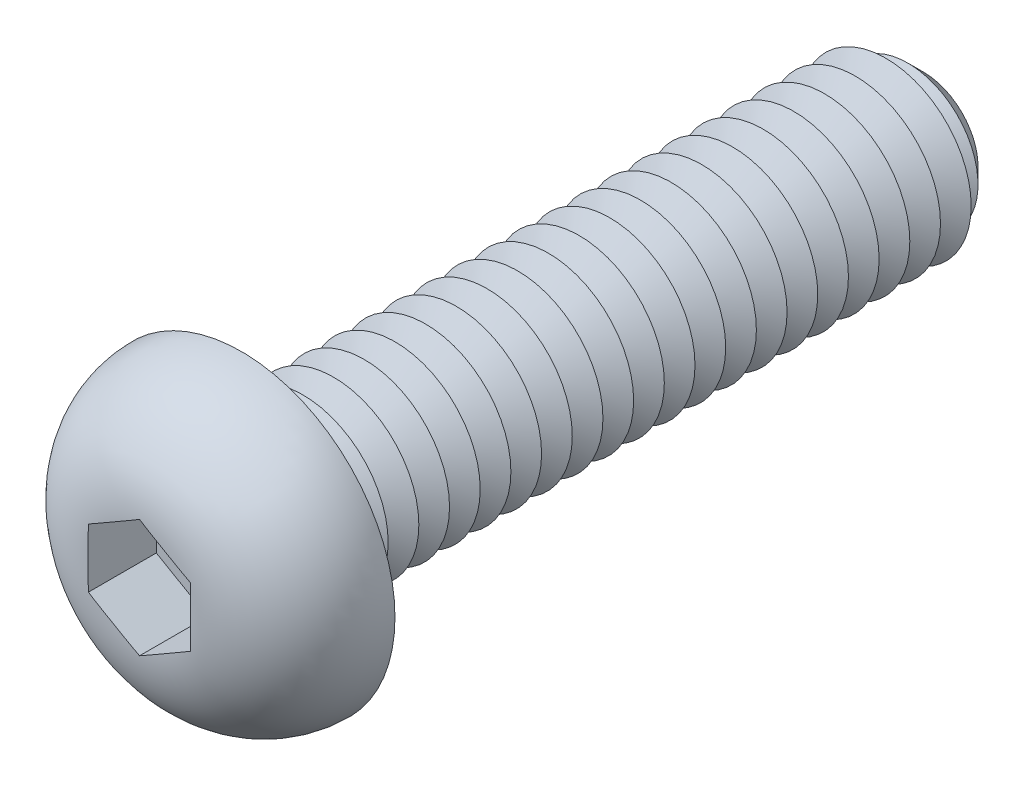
ISO-10303-21;
HEADER;
FILE_DESCRIPTION(('STEP AP214'),'2;1');
FILE_NAME('part.step','',(''),(''),'','','');
FILE_SCHEMA(('AUTOMOTIVE_DESIGN { 1 0 10303 214 1 1 1 1 }'));
ENDSEC;
DATA;
#1=APPLICATION_CONTEXT('core data for automotive mechanical design processes');
#2=APPLICATION_PROTOCOL_DEFINITION('international standard','automotive_design',2000,#1);
#3=PRODUCT_CONTEXT('',#1,'mechanical');
#4=PRODUCT('Part','Part','',(#3));
#5=PRODUCT_RELATED_PRODUCT_CATEGORY('part','',(#4));
#6=PRODUCT_DEFINITION_FORMATION('','',#4);
#7=PRODUCT_DEFINITION_CONTEXT('part definition',#1,'design');
#8=PRODUCT_DEFINITION('design','',#6,#7);
#9=PRODUCT_DEFINITION_SHAPE('','',#8);
#10=(LENGTH_UNIT() NAMED_UNIT(*) SI_UNIT(.MILLI.,.METRE.));
#11=(NAMED_UNIT(*) PLANE_ANGLE_UNIT() SI_UNIT($,.RADIAN.));
#12=(NAMED_UNIT(*) SI_UNIT($,.STERADIAN.) SOLID_ANGLE_UNIT());
#13=UNCERTAINTY_MEASURE_WITH_UNIT(LENGTH_MEASURE(1.E-05),#10,'distance_accuracy_value','');
#14=(GEOMETRIC_REPRESENTATION_CONTEXT(3) GLOBAL_UNCERTAINTY_ASSIGNED_CONTEXT((#13)) GLOBAL_UNIT_ASSIGNED_CONTEXT((#10,
#11,#12)) REPRESENTATION_CONTEXT('',''));
#15=CARTESIAN_POINT('',(0.,0.,0.));
#16=DIRECTION('',(0.,0.,1.));
#17=DIRECTION('',(1.,0.,0.));
#18=AXIS2_PLACEMENT_3D('',#15,#16,#17);
#19=CARTESIAN_POINT('',(0.,0.,-10.));
#20=DIRECTION('',(0.,0.,1.));
#21=DIRECTION('',(1.,0.,0.));
#22=AXIS2_PLACEMENT_3D('',#19,#20,#21);
#23=CYLINDRICAL_SURFACE('',#22,1.25);
#24=CARTESIAN_POINT('',(0.,0.,-0.225));
#25=DIRECTION('',(0.,0.,1.));
#26=DIRECTION('',(1.,0.,0.));
#27=AXIS2_PLACEMENT_3D('',#24,#25,#26);
#28=CIRCLE('',#27,1.25);
#29=CARTESIAN_POINT('',(1.25,0.,-0.225));
#30=VERTEX_POINT('',#29);
#31=EDGE_CURVE('E48',#30,#30,#28,.F.);
#32=ORIENTED_EDGE('',*,*,#31,.T.);
#33=EDGE_LOOP('',(#32));
#34=FACE_BOUND('',#33,.T.);
#35=CARTESIAN_POINT('',(0.,0.,-0.449999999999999));
#36=DIRECTION('',(0.,0.,1.));
#37=DIRECTION('',(1.,0.,0.));
#38=AXIS2_PLACEMENT_3D('',#35,#36,#37);
#39=CIRCLE('',#38,1.25);
#40=CARTESIAN_POINT('',(1.25,0.,-0.449999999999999));
#41=VERTEX_POINT('',#40);
#42=EDGE_CURVE('E116',#41,#41,#39,.T.);
#43=ORIENTED_EDGE('',*,*,#42,.T.);
#44=EDGE_LOOP('',(#43));
#45=FACE_BOUND('',#44,.T.);
#46=ADVANCED_FACE('F39',(#34,#45),#23,.T.);
#47=CARTESIAN_POINT('',(0.,2.25,0.));
#48=DIRECTION('',(0.,0.,1.));
#49=DIRECTION('',(1.,0.,0.));
#50=AXIS2_PLACEMENT_3D('',#47,#48,#49);
#51=PLANE('',#50);
#52=CARTESIAN_POINT('',(0.,0.,0.));
#53=DIRECTION('',(0.,0.,1.));
#54=DIRECTION('',(1.,0.,0.));
#55=AXIS2_PLACEMENT_3D('',#52,#53,#54);
#56=CIRCLE('',#55,1.475);
#57=CARTESIAN_POINT('',(1.475,0.,0.));
#58=VERTEX_POINT('',#57);
#59=EDGE_CURVE('E11',#58,#58,#56,.T.);
#60=ORIENTED_EDGE('',*,*,#59,.T.);
#61=EDGE_LOOP('',(#60));
#62=FACE_BOUND('',#61,.T.);
#63=CARTESIAN_POINT('',(0.,0.,0.));
#64=DIRECTION('',(0.,0.,1.));
#65=DIRECTION('',(1.,0.,0.));
#66=AXIS2_PLACEMENT_3D('',#63,#64,#65);
#67=CIRCLE('',#66,2.25);
#68=CARTESIAN_POINT('',(2.25,0.,0.));
#69=VERTEX_POINT('',#68);
#70=EDGE_CURVE('E140',#69,#69,#67,.T.);
#71=ORIENTED_EDGE('',*,*,#70,.F.);
#72=EDGE_LOOP('',(#71));
#73=FACE_BOUND('',#72,.T.);
#74=ADVANCED_FACE('F250',(#62,#73),#51,.F.);
#75=CARTESIAN_POINT('',(0.,0.,0.));
#76=DIRECTION('',(0.,0.,1.));
#77=DIRECTION('',(1.,0.,0.));
#78=AXIS2_PLACEMENT_3D('',#75,#76,#77);
#79=DEGENERATE_TOROIDAL_SURFACE('',#78,0.75,1.5,.T.);
#80=CARTESIAN_POINT('',(-0.00020000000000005,0.866140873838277,1.49549700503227));
#81=CARTESIAN_POINT('',(0.0310550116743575,0.848095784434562,1.4968946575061));
#82=CARTESIAN_POINT('',(0.0623199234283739,0.83004497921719,1.49783965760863));
#83=CARTESIAN_POINT('',(0.124855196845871,0.793940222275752,1.49913317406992));
#84=CARTESIAN_POINT('',(0.156125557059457,0.775886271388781,1.49948177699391));
#85=CARTESIAN_POINT('',(0.218662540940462,0.739780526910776,1.49989152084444));
#86=CARTESIAN_POINT('',(0.249929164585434,0.7217287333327,1.49995269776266));
#87=CARTESIAN_POINT('',(0.312463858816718,0.685624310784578,1.50000693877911));
#88=CARTESIAN_POINT('',(0.343731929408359,0.667571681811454,1.5));
#89=CARTESIAN_POINT('',(0.40626807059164,0.631466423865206,1.5));
#90=CARTESIAN_POINT('',(0.437536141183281,0.613413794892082,1.50000693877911));
#91=CARTESIAN_POINT('',(0.500070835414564,0.577309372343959,1.49995269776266));
#92=CARTESIAN_POINT('',(0.531337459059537,0.559257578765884,1.49989152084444));
#93=CARTESIAN_POINT('',(0.593874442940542,0.523151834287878,1.49948177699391));
#94=CARTESIAN_POINT('',(0.625144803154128,0.505097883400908,1.49913317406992));
#95=CARTESIAN_POINT('',(0.687680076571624,0.468993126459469,1.49783965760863));
#96=CARTESIAN_POINT('',(0.718944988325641,0.450942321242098,1.49689465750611));
#97=CARTESIAN_POINT('',(0.750199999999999,0.432897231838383,1.4954970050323));
#98=B_SPLINE_CURVE_WITH_KNOTS('',3,(#80,#81,#82,#83,#84,#85,#86,#87,#88,#89,#90,#91,#92,#93,#94,
#95,#96,#97),.UNSPECIFIED.,.F.,.F.,(4,2,2,2,2,2,2,2,4),(0.,0.108340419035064,0.216665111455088,
0.324976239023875,0.433291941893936,0.541607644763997,0.649918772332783,0.758243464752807,
0.866583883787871),.UNSPECIFIED.);
#99=CARTESIAN_POINT('',(0.,0.866025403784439,1.49550596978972));
#100=VERTEX_POINT('',#99);
#101=CARTESIAN_POINT('',(0.75,0.43301270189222,1.49550596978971));
#102=VERTEX_POINT('',#101);
#103=EDGE_CURVE('E62',#100,#102,#98,.T.);
#104=ORIENTED_EDGE('',*,*,#103,.T.);
#105=CARTESIAN_POINT('',(0.75,0.,1.5));
#106=CARTESIAN_POINT('',(0.75,-0.0627080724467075,1.50000006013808));
#107=CARTESIAN_POINT('',(0.75,-0.125416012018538,1.50006294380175));
#108=CARTESIAN_POINT('',(0.75,-0.250852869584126,1.49957707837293));
#109=CARTESIAN_POINT('',(0.75,-0.313581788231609,1.49902814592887));
#110=CARTESIAN_POINT('',(0.75,-0.438802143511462,1.49567950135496));
#111=CARTESIAN_POINT('',(0.75,-0.501293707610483,1.49288685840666));
#112=CARTESIAN_POINT('',(0.75,-0.625982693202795,1.48341085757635));
#113=CARTESIAN_POINT('',(0.75,-0.688180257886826,1.47672964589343));
#114=CARTESIAN_POINT('',(0.75,-0.798866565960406,1.46016399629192));
#115=CARTESIAN_POINT('',(0.75,-0.847497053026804,1.45124406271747));
#116=CARTESIAN_POINT('',(0.75,-0.943962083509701,1.42976864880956));
#117=CARTESIAN_POINT('',(0.75,-0.991796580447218,1.41721295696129));
#118=CARTESIAN_POINT('',(0.75,-1.08630476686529,1.38817887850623));
#119=CARTESIAN_POINT('',(0.75,-1.13297775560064,1.37169818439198));
#120=CARTESIAN_POINT('',(0.75,-1.22469462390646,1.33469293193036));
#121=CARTESIAN_POINT('',(0.75,-1.26973805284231,1.31416726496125));
#122=CARTESIAN_POINT('',(0.75,-1.40247100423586,1.24607127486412));
#123=CARTESIAN_POINT('',(0.750000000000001,-1.48705462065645,1.19219273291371));
#124=CARTESIAN_POINT('',(0.750000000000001,-1.64393724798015,1.06881737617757));
#125=CARTESIAN_POINT('',(0.750000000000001,-1.71623917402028,0.99932427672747));
#126=CARTESIAN_POINT('',(0.750000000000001,-1.83613547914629,0.857842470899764));
#127=CARTESIAN_POINT('',(0.750000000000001,-1.88577468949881,0.787579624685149));
#128=CARTESIAN_POINT('',(0.750000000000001,-1.97175648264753,0.639365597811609));
#129=CARTESIAN_POINT('',(0.750000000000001,-2.00810707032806,0.56141908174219));
#130=CARTESIAN_POINT('',(0.750000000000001,-2.06466924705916,0.404589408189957));
#131=CARTESIAN_POINT('',(0.750000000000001,-2.08563938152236,0.325978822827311));
#132=CARTESIAN_POINT('',(0.750000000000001,-2.11383941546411,0.166329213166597));
#133=CARTESIAN_POINT('',(0.750000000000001,-2.12107071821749,0.0852904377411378));
#134=CARTESIAN_POINT('',(0.750000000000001,-2.12155325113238,-0.0754758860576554));
#135=CARTESIAN_POINT('',(0.750000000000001,-2.11503465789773,-0.155202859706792));
#136=CARTESIAN_POINT('',(0.750000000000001,-2.08869127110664,-0.312426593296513));
#137=CARTESIAN_POINT('',(0.750000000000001,-2.06886647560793,-0.389923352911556));
#138=CARTESIAN_POINT('',(0.750000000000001,-2.01655236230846,-0.540457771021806));
#139=CARTESIAN_POINT('',(0.750000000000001,-1.98407088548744,-0.613498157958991));
#140=CARTESIAN_POINT('',(0.750000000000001,-1.9074704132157,-0.753167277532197));
#141=CARTESIAN_POINT('',(0.750000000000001,-1.86335369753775,-0.81979726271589));
#142=CARTESIAN_POINT('',(0.750000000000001,-1.76418094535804,-0.945786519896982));
#143=CARTESIAN_POINT('',(0.750000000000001,-1.70898715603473,-1.00503724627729));
#144=CARTESIAN_POINT('',(0.750000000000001,-1.58971135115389,-1.11387170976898));
#145=CARTESIAN_POINT('',(0.75,-1.52562045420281,-1.16344566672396));
#146=CARTESIAN_POINT('',(0.75,-1.38780810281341,-1.25370948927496));
#147=CARTESIAN_POINT('',(0.75,-1.31380696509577,-1.29397311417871));
#148=CARTESIAN_POINT('',(0.75,-1.19908931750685,-1.34544517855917));
#149=CARTESIAN_POINT('',(0.75,-1.16029271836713,-1.36109820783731));
#150=CARTESIAN_POINT('',(0.75,-1.08166825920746,-1.38954640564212));
#151=CARTESIAN_POINT('',(0.75,-1.04184052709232,-1.40234192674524));
#152=CARTESIAN_POINT('',(0.75,-0.922724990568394,-1.43614112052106));
#153=CARTESIAN_POINT('',(0.75,-0.842305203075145,-1.45321262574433));
#154=CARTESIAN_POINT('',(0.75,-0.680054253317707,-1.47833811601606));
#155=CARTESIAN_POINT('',(0.75,-0.598220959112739,-1.48637700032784));
#156=CARTESIAN_POINT('',(0.75,-0.432952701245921,-1.4964806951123));
#157=CARTESIAN_POINT('',(0.75,-0.349513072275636,-1.49844778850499));
#158=CARTESIAN_POINT('',(0.75,-0.224384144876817,-1.49972680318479));
#159=CARTESIAN_POINT('',(0.75,-0.182687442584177,-1.49987466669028));
#160=CARTESIAN_POINT('',(0.75,-0.0992944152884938,-1.50001027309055));
#161=CARTESIAN_POINT('',(0.75,-0.0575980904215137,-1.49999802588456));
#162=CARTESIAN_POINT('',(0.75,0.0343362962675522,-1.50000235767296));
#163=CARTESIAN_POINT('',(0.75,0.0845742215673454,-1.50002535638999));
#164=CARTESIAN_POINT('',(0.75,0.185055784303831,-1.49987831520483));
#165=CARTESIAN_POINT('',(0.75,0.235299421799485,-1.49970825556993));
#166=CARTESIAN_POINT('',(0.75,0.335816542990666,-1.49845206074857));
#167=CARTESIAN_POINT('',(0.75,0.386090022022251,-1.49736526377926));
#168=CARTESIAN_POINT('',(0.75,0.486569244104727,-1.49338674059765));
#169=CARTESIAN_POINT('',(0.75,0.536774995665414,-1.49049526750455));
#170=CARTESIAN_POINT('',(0.75,0.636034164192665,-1.4821682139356));
#171=CARTESIAN_POINT('',(0.75,0.685091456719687,-1.47678164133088));
#172=CARTESIAN_POINT('',(0.75,0.78275573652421,-1.46286947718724));
#173=CARTESIAN_POINT('',(0.75,0.831362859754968,-1.45434486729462));
#174=CARTESIAN_POINT('',(0.75,0.92771552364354,-1.43373454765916));
#175=CARTESIAN_POINT('',(0.75,0.975462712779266,-1.42165664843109));
#176=CARTESIAN_POINT('',(0.75,1.06980144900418,-1.39365234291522));
#177=CARTESIAN_POINT('',(0.75,1.11639353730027,-1.37772777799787));
#178=CARTESIAN_POINT('',(0.75,1.20164461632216,-1.3443737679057));
#179=CARTESIAN_POINT('',(0.75,1.24050600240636,-1.32746129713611));
#180=CARTESIAN_POINT('',(0.75,1.31679530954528,-1.29064565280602));
#181=CARTESIAN_POINT('',(0.75,1.35422305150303,-1.27074210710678));
#182=CARTESIAN_POINT('',(0.75,1.42755003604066,-1.22785786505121));
#183=CARTESIAN_POINT('',(0.75,1.46343995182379,-1.20486115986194));
#184=CARTESIAN_POINT('',(0.75,1.53317270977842,-1.15597138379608));
#185=CARTESIAN_POINT('',(0.75,1.56701570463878,-1.1300785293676));
#186=CARTESIAN_POINT('',(0.75,1.66513078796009,-1.04815589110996));
#187=CARTESIAN_POINT('',(0.75,1.72596640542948,-0.987895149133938));
#188=CARTESIAN_POINT('',(0.75,1.83611610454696,-0.857815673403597));
#189=CARTESIAN_POINT('',(0.75,1.88544739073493,-0.78801146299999));
#190=CARTESIAN_POINT('',(0.75,1.96970141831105,-0.64303465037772));
#191=CARTESIAN_POINT('',(0.75,2.00501928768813,-0.568092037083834));
#192=CARTESIAN_POINT('',(0.75,2.06216371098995,-0.413201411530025));
#193=CARTESIAN_POINT('',(0.75,2.08398748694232,-0.333252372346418));
#194=CARTESIAN_POINT('',(0.75,2.11297506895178,-0.173098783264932));
#195=CARTESIAN_POINT('',(0.75,2.12053880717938,-0.0929664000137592));
#196=CARTESIAN_POINT('',(0.75,2.1219864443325,0.0674127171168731));
#197=CARTESIAN_POINT('',(0.75,2.1158724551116,0.147659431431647));
#198=CARTESIAN_POINT('',(0.75,2.09026719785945,0.305329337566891));
#199=CARTESIAN_POINT('',(0.75,2.07088260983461,0.382769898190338));
#200=CARTESIAN_POINT('',(0.75,2.01945905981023,0.53332273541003));
#201=CARTESIAN_POINT('',(0.75,1.98742024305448,0.606435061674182));
#202=CARTESIAN_POINT('',(0.75,1.91146692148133,0.746751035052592));
#203=CARTESIAN_POINT('',(0.75,1.86748433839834,0.813917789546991));
#204=CARTESIAN_POINT('',(0.75,1.76910058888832,0.940116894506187));
#205=CARTESIAN_POINT('',(0.75,1.71469868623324,0.999148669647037));
#206=CARTESIAN_POINT('',(0.75,1.59577189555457,1.10896258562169));
#207=CARTESIAN_POINT('',(0.75,1.53104176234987,1.15952203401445));
#208=CARTESIAN_POINT('',(0.75,1.3944150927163,1.24972990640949));
#209=CARTESIAN_POINT('',(0.75,1.32251811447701,1.28937765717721));
#210=CARTESIAN_POINT('',(0.75,1.16914901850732,1.35951213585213));
#211=CARTESIAN_POINT('',(0.75,1.08736098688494,1.38930295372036));
#212=CARTESIAN_POINT('',(0.75,0.920496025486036,1.43689243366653));
#213=CARTESIAN_POINT('',(0.75,0.835420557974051,1.45469636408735));
#214=CARTESIAN_POINT('',(0.75,0.687870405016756,1.476773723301));
#215=CARTESIAN_POINT('',(0.75,0.625720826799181,1.48343749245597));
#216=CARTESIAN_POINT('',(0.75,0.501109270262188,1.49289411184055));
#217=CARTESIAN_POINT('',(0.75,0.438647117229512,1.49568447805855));
#218=CARTESIAN_POINT('',(0.75,0.313477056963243,1.49903009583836));
#219=CARTESIAN_POINT('',(0.75,0.250769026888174,1.49957783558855));
#220=CARTESIAN_POINT('',(0.75,0.125373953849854,1.50006266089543));
#221=CARTESIAN_POINT('',(0.75,0.0626869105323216,1.49999993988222));
#222=CARTESIAN_POINT('',(0.75,0.,1.5));
#223=B_SPLINE_CURVE_WITH_KNOTS('',3,(#105,#106,#107,#108,#109,#110,#111,#112,#113,#114,#115,
#116,#117,#118,#119,#120,#121,#122,#123,#124,#125,#126,#127,#128,#129,#130,#131,#132,#133,#134,
#135,#136,#137,#138,#139,#140,#141,#142,#143,#144,#145,#146,#147,#148,#149,#150,#151,#152,#153,
#154,#155,#156,#157,#158,#159,#160,#161,#162,#163,#164,#165,#166,#167,#168,#169,#170,#171,#172,
#173,#174,#175,#176,#177,#178,#179,#180,#181,#182,#183,#184,#185,#186,#187,#188,#189,#190,#191,
#192,#193,#194,#195,#196,#197,#198,#199,#200,#201,#202,#203,#204,#205,#206,#207,#208,#209,#210,
#211,#212,#213,#214,#215,#216,#217,#218,#219,#220,#221,#222),.UNSPECIFIED.,.T.,.F.,(4,2,2,2,2,2,
2,2,2,2,2,2,2,2,2,2,2,2,2,2,2,2,2,2,2,2,2,2,2,2,2,2,2,2,2,2,2,2,2,2,2,2,2,2,2,2,2,2,2,2,2,2,2,2,
2,2,2,2,4),(0.,0.188125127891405,0.376306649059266,0.563897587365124,0.75138508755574,
0.899588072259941,1.04779968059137,1.19609863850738,1.34443829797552,1.64330264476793,
1.94209595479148,2.19886247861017,2.45547407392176,2.69837467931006,2.94125047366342,
3.18009276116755,3.418935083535,3.65762967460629,3.89627753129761,4.13810096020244,
4.38016754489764,4.63175737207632,4.75717060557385,4.88256835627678,5.12849835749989,
5.37483889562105,5.62512380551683,5.75021912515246,5.87530671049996,6.02602122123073,
6.17675113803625,6.32758995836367,6.47840762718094,6.62638101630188,6.77430815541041,
6.92191253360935,7.06944639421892,7.19647012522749,7.32350967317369,7.4512340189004,
7.57894882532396,7.83445576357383,8.08957810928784,8.33688433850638,8.58424146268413,
8.82455168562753,9.06482480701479,9.30318875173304,9.54154996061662,9.781299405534,
10.0210657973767,10.266384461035,10.511718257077,10.7718340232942,11.0318353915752,
11.219209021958,11.4067027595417,11.5948240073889,11.7828856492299),.UNSPECIFIED.);
#224=CARTESIAN_POINT('',(0.75,-0.43301270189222,1.49550596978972));
#225=VERTEX_POINT('',#224);
#226=EDGE_CURVE('E215',#102,#225,#223,.T.);
#227=ORIENTED_EDGE('',*,*,#226,.T.);
#228=CARTESIAN_POINT('',(0.7502,-0.432897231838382,1.49549700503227));
#229=CARTESIAN_POINT('',(0.718944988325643,-0.450942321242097,1.4968946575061));
#230=CARTESIAN_POINT('',(0.687680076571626,-0.468993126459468,1.49783965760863));
#231=CARTESIAN_POINT('',(0.625144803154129,-0.505097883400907,1.49913317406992));
#232=CARTESIAN_POINT('',(0.593874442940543,-0.523151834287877,1.49948177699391));
#233=CARTESIAN_POINT('',(0.531337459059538,-0.559257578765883,1.49989152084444));
#234=CARTESIAN_POINT('',(0.500070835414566,-0.577309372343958,1.49995269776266));
#235=CARTESIAN_POINT('',(0.437536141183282,-0.613413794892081,1.50000693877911));
#236=CARTESIAN_POINT('',(0.406268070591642,-0.631466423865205,1.5));
#237=CARTESIAN_POINT('',(0.34373192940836,-0.667571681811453,1.5));
#238=CARTESIAN_POINT('',(0.312463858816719,-0.685624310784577,1.50000693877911));
#239=CARTESIAN_POINT('',(0.249929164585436,-0.721728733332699,1.49995269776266));
#240=CARTESIAN_POINT('',(0.218662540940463,-0.739780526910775,1.49989152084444));
#241=CARTESIAN_POINT('',(0.156125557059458,-0.77588627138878,1.49948177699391));
#242=CARTESIAN_POINT('',(0.124855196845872,-0.793940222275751,1.49913317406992));
#243=CARTESIAN_POINT('',(0.0623199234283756,-0.830044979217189,1.49783965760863));
#244=CARTESIAN_POINT('',(0.0310550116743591,-0.848095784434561,1.49689465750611));
#245=CARTESIAN_POINT('',(-0.000199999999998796,-0.866140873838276,1.4954970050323));
#246=B_SPLINE_CURVE_WITH_KNOTS('',3,(#228,#229,#230,#231,#232,#233,#234,#235,#236,#237,#238,
#239,#240,#241,#242,#243,#244,#245),.UNSPECIFIED.,.F.,.F.,(4,2,2,2,2,2,2,2,4),(0.,
0.108340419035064,0.216665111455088,0.324976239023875,0.433291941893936,0.541607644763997,
0.649918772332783,0.758243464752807,0.866583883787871),.UNSPECIFIED.);
#247=CARTESIAN_POINT('',(0.,-0.866025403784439,1.49550596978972));
#248=VERTEX_POINT('',#247);
#249=EDGE_CURVE('E195',#225,#248,#246,.T.);
#250=ORIENTED_EDGE('',*,*,#249,.T.);
#251=CARTESIAN_POINT('',(0.000200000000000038,-0.866140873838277,1.49549700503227));
#252=CARTESIAN_POINT('',(-0.0310550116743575,-0.848095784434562,1.4968946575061));
#253=CARTESIAN_POINT('',(-0.0623199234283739,-0.83004497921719,1.49783965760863));
#254=CARTESIAN_POINT('',(-0.124855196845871,-0.793940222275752,1.49913317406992));
#255=CARTESIAN_POINT('',(-0.156125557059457,-0.775886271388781,1.49948177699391));
#256=CARTESIAN_POINT('',(-0.218662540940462,-0.739780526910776,1.49989152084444));
#257=CARTESIAN_POINT('',(-0.249929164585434,-0.7217287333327,1.49995269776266));
#258=CARTESIAN_POINT('',(-0.312463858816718,-0.685624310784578,1.50000693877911));
#259=CARTESIAN_POINT('',(-0.343731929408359,-0.667571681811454,1.5));
#260=CARTESIAN_POINT('',(-0.40626807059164,-0.631466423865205,1.5));
#261=CARTESIAN_POINT('',(-0.437536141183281,-0.613413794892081,1.50000693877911));
#262=CARTESIAN_POINT('',(-0.500070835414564,-0.577309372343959,1.49995269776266));
#263=CARTESIAN_POINT('',(-0.531337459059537,-0.559257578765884,1.49989152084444));
#264=CARTESIAN_POINT('',(-0.593874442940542,-0.523151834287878,1.49948177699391));
#265=CARTESIAN_POINT('',(-0.625144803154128,-0.505097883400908,1.49913317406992));
#266=CARTESIAN_POINT('',(-0.687680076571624,-0.468993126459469,1.49783965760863));
#267=CARTESIAN_POINT('',(-0.718944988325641,-0.450942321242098,1.49689465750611));
#268=CARTESIAN_POINT('',(-0.750199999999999,-0.432897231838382,1.4954970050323));
#269=B_SPLINE_CURVE_WITH_KNOTS('',3,(#251,#252,#253,#254,#255,#256,#257,#258,#259,#260,#261,
#262,#263,#264,#265,#266,#267,#268),.UNSPECIFIED.,.F.,.F.,(4,2,2,2,2,2,2,2,4),(0.,
0.108340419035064,0.216665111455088,0.324976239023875,0.433291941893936,0.541607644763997,
0.649918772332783,0.758243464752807,0.866583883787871),.UNSPECIFIED.);
#270=CARTESIAN_POINT('',(-0.75,-0.433012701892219,1.49550596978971));
#271=VERTEX_POINT('',#270);
#272=EDGE_CURVE('E188',#248,#271,#269,.T.);
#273=ORIENTED_EDGE('',*,*,#272,.T.);
#274=CARTESIAN_POINT('',(-0.75,0.,1.5));
#275=CARTESIAN_POINT('',(-0.75,0.0627080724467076,1.50000006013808));
#276=CARTESIAN_POINT('',(-0.75,0.125416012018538,1.50006294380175));
#277=CARTESIAN_POINT('',(-0.75,0.250852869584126,1.49957707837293));
#278=CARTESIAN_POINT('',(-0.75,0.313581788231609,1.49902814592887));
#279=CARTESIAN_POINT('',(-0.75,0.438802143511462,1.49567950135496));
#280=CARTESIAN_POINT('',(-0.75,0.501293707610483,1.49288685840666));
#281=CARTESIAN_POINT('',(-0.75,0.625982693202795,1.48341085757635));
#282=CARTESIAN_POINT('',(-0.75,0.688180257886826,1.47672964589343));
#283=CARTESIAN_POINT('',(-0.75,0.798866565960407,1.46016399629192));
#284=CARTESIAN_POINT('',(-0.75,0.847497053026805,1.45124406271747));
#285=CARTESIAN_POINT('',(-0.75,0.943962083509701,1.42976864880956));
#286=CARTESIAN_POINT('',(-0.75,0.991796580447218,1.41721295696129));
#287=CARTESIAN_POINT('',(-0.75,1.08630476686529,1.38817887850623));
#288=CARTESIAN_POINT('',(-0.75,1.13297775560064,1.37169818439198));
#289=CARTESIAN_POINT('',(-0.75,1.22469462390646,1.33469293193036));
#290=CARTESIAN_POINT('',(-0.75,1.26973805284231,1.31416726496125));
#291=CARTESIAN_POINT('',(-0.75,1.40247100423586,1.24607127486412));
#292=CARTESIAN_POINT('',(-0.75,1.48705462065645,1.19219273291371));
#293=CARTESIAN_POINT('',(-0.75,1.64393724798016,1.06881737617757));
#294=CARTESIAN_POINT('',(-0.75,1.71623917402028,0.99932427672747));
#295=CARTESIAN_POINT('',(-0.75,1.83613547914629,0.857842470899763));
#296=CARTESIAN_POINT('',(-0.75,1.88577468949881,0.787579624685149));
#297=CARTESIAN_POINT('',(-0.75,1.97175648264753,0.639365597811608));
#298=CARTESIAN_POINT('',(-0.75,2.00810707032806,0.561419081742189));
#299=CARTESIAN_POINT('',(-0.75,2.06466924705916,0.404589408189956));
#300=CARTESIAN_POINT('',(-0.75,2.08563938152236,0.325978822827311));
#301=CARTESIAN_POINT('',(-0.75,2.11383941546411,0.166329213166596));
#302=CARTESIAN_POINT('',(-0.75,2.12107071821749,0.0852904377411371));
#303=CARTESIAN_POINT('',(-0.75,2.12155325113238,-0.0754758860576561));
#304=CARTESIAN_POINT('',(-0.75,2.11503465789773,-0.155202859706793));
#305=CARTESIAN_POINT('',(-0.75,2.08869127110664,-0.312426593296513));
#306=CARTESIAN_POINT('',(-0.75,2.06886647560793,-0.389923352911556));
#307=CARTESIAN_POINT('',(-0.75,2.01655236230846,-0.540457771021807));
#308=CARTESIAN_POINT('',(-0.75,1.98407088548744,-0.613498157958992));
#309=CARTESIAN_POINT('',(-0.75,1.9074704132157,-0.753167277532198));
#310=CARTESIAN_POINT('',(-0.75,1.86335369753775,-0.81979726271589));
#311=CARTESIAN_POINT('',(-0.75,1.76418094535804,-0.945786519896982));
#312=CARTESIAN_POINT('',(-0.75,1.70898715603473,-1.00503724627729));
#313=CARTESIAN_POINT('',(-0.75,1.58971135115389,-1.11387170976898));
#314=CARTESIAN_POINT('',(-0.75,1.52562045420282,-1.16344566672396));
#315=CARTESIAN_POINT('',(-0.75,1.38780810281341,-1.25370948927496));
#316=CARTESIAN_POINT('',(-0.75,1.31380696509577,-1.29397311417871));
#317=CARTESIAN_POINT('',(-0.75,1.19908931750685,-1.34544517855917));
#318=CARTESIAN_POINT('',(-0.75,1.16029271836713,-1.36109820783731));
#319=CARTESIAN_POINT('',(-0.75,1.08166825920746,-1.38954640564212));
#320=CARTESIAN_POINT('',(-0.75,1.04184052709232,-1.40234192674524));
#321=CARTESIAN_POINT('',(-0.75,0.922724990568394,-1.43614112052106));
#322=CARTESIAN_POINT('',(-0.75,0.842305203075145,-1.45321262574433));
#323=CARTESIAN_POINT('',(-0.75,0.680054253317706,-1.47833811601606));
#324=CARTESIAN_POINT('',(-0.75,0.598220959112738,-1.48637700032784));
#325=CARTESIAN_POINT('',(-0.75,0.43295270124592,-1.4964806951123));
#326=CARTESIAN_POINT('',(-0.75,0.349513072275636,-1.49844778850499));
#327=CARTESIAN_POINT('',(-0.75,0.224384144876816,-1.49972680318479));
#328=CARTESIAN_POINT('',(-0.75,0.182687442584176,-1.49987466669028));
#329=CARTESIAN_POINT('',(-0.75,0.0992944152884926,-1.50001027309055));
#330=CARTESIAN_POINT('',(-0.75,0.0575980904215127,-1.49999802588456));
#331=CARTESIAN_POINT('',(-0.75,-0.0343362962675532,-1.50000235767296));
#332=CARTESIAN_POINT('',(-0.75,-0.0845742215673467,-1.50002535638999));
#333=CARTESIAN_POINT('',(-0.75,-0.185055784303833,-1.49987831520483));
#334=CARTESIAN_POINT('',(-0.75,-0.235299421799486,-1.49970825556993));
#335=CARTESIAN_POINT('',(-0.75,-0.335816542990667,-1.49845206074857));
#336=CARTESIAN_POINT('',(-0.75,-0.386090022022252,-1.49736526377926));
#337=CARTESIAN_POINT('',(-0.75,-0.486569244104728,-1.49338674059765));
#338=CARTESIAN_POINT('',(-0.75,-0.536774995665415,-1.49049526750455));
#339=CARTESIAN_POINT('',(-0.75,-0.636034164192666,-1.4821682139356));
#340=CARTESIAN_POINT('',(-0.75,-0.685091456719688,-1.47678164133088));
#341=CARTESIAN_POINT('',(-0.75,-0.782755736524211,-1.46286947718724));
#342=CARTESIAN_POINT('',(-0.75,-0.831362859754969,-1.45434486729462));
#343=CARTESIAN_POINT('',(-0.75,-0.927715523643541,-1.43373454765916));
#344=CARTESIAN_POINT('',(-0.75,-0.975462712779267,-1.42165664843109));
#345=CARTESIAN_POINT('',(-0.75,-1.06980144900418,-1.39365234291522));
#346=CARTESIAN_POINT('',(-0.75,-1.11639353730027,-1.37772777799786));
#347=CARTESIAN_POINT('',(-0.75,-1.20164461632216,-1.3443737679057));
#348=CARTESIAN_POINT('',(-0.75,-1.24050600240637,-1.32746129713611));
#349=CARTESIAN_POINT('',(-0.75,-1.31679530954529,-1.29064565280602));
#350=CARTESIAN_POINT('',(-0.75,-1.35422305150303,-1.27074210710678));
#351=CARTESIAN_POINT('',(-0.75,-1.42755003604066,-1.22785786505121));
#352=CARTESIAN_POINT('',(-0.75,-1.46343995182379,-1.20486115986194));
#353=CARTESIAN_POINT('',(-0.75,-1.53317270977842,-1.15597138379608));
#354=CARTESIAN_POINT('',(-0.75,-1.56701570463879,-1.1300785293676));
#355=CARTESIAN_POINT('',(-0.75,-1.66513078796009,-1.04815589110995));
#356=CARTESIAN_POINT('',(-0.75,-1.72596640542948,-0.987895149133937));
#357=CARTESIAN_POINT('',(-0.75,-1.83611610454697,-0.857815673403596));
#358=CARTESIAN_POINT('',(-0.75,-1.88544739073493,-0.788011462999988));
#359=CARTESIAN_POINT('',(-0.75,-1.96970141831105,-0.643034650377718));
#360=CARTESIAN_POINT('',(-0.75,-2.00501928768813,-0.568092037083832));
#361=CARTESIAN_POINT('',(-0.75,-2.06216371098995,-0.413201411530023));
#362=CARTESIAN_POINT('',(-0.75,-2.08398748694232,-0.333252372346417));
#363=CARTESIAN_POINT('',(-0.75,-2.11297506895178,-0.173098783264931));
#364=CARTESIAN_POINT('',(-0.75,-2.12053880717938,-0.0929664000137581));
#365=CARTESIAN_POINT('',(-0.75,-2.1219864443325,0.0674127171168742));
#366=CARTESIAN_POINT('',(-0.75,-2.1158724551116,0.147659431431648));
#367=CARTESIAN_POINT('',(-0.75,-2.09026719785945,0.305329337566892));
#368=CARTESIAN_POINT('',(-0.75,-2.07088260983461,0.382769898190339));
#369=CARTESIAN_POINT('',(-0.75,-2.01945905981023,0.533322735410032));
#370=CARTESIAN_POINT('',(-0.75,-1.98742024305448,0.606435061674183));
#371=CARTESIAN_POINT('',(-0.75,-1.91146692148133,0.746751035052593));
#372=CARTESIAN_POINT('',(-0.75,-1.86748433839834,0.813917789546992));
#373=CARTESIAN_POINT('',(-0.75,-1.76910058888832,0.940116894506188));
#374=CARTESIAN_POINT('',(-0.75,-1.71469868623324,0.999148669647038));
#375=CARTESIAN_POINT('',(-0.75,-1.59577189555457,1.10896258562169));
#376=CARTESIAN_POINT('',(-0.75,-1.53104176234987,1.15952203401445));
#377=CARTESIAN_POINT('',(-0.75,-1.3944150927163,1.24972990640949));
#378=CARTESIAN_POINT('',(-0.75,-1.32251811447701,1.28937765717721));
#379=CARTESIAN_POINT('',(-0.75,-1.16914901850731,1.35951213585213));
#380=CARTESIAN_POINT('',(-0.75,-1.08736098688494,1.38930295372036));
#381=CARTESIAN_POINT('',(-0.75,-0.920496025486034,1.43689243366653));
#382=CARTESIAN_POINT('',(-0.75,-0.83542055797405,1.45469636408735));
#383=CARTESIAN_POINT('',(-0.75,-0.687870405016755,1.476773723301));
#384=CARTESIAN_POINT('',(-0.75,-0.625720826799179,1.48343749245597));
#385=CARTESIAN_POINT('',(-0.75,-0.501109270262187,1.49289411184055));
#386=CARTESIAN_POINT('',(-0.75,-0.438647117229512,1.49568447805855));
#387=CARTESIAN_POINT('',(-0.75,-0.313477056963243,1.49903009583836));
#388=CARTESIAN_POINT('',(-0.75,-0.250769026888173,1.49957783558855));
#389=CARTESIAN_POINT('',(-0.75,-0.125373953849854,1.50006266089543));
#390=CARTESIAN_POINT('',(-0.75,-0.0626869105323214,1.49999993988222));
#391=CARTESIAN_POINT('',(-0.75,0.,1.5));
#392=B_SPLINE_CURVE_WITH_KNOTS('',3,(#274,#275,#276,#277,#278,#279,#280,#281,#282,#283,#284,
#285,#286,#287,#288,#289,#290,#291,#292,#293,#294,#295,#296,#297,#298,#299,#300,#301,#302,#303,
#304,#305,#306,#307,#308,#309,#310,#311,#312,#313,#314,#315,#316,#317,#318,#319,#320,#321,#322,
#323,#324,#325,#326,#327,#328,#329,#330,#331,#332,#333,#334,#335,#336,#337,#338,#339,#340,#341,
#342,#343,#344,#345,#346,#347,#348,#349,#350,#351,#352,#353,#354,#355,#356,#357,#358,#359,#360,
#361,#362,#363,#364,#365,#366,#367,#368,#369,#370,#371,#372,#373,#374,#375,#376,#377,#378,#379,
#380,#381,#382,#383,#384,#385,#386,#387,#388,#389,#390,#391),.UNSPECIFIED.,.T.,.F.,(4,2,2,2,2,2,
2,2,2,2,2,2,2,2,2,2,2,2,2,2,2,2,2,2,2,2,2,2,2,2,2,2,2,2,2,2,2,2,2,2,2,2,2,2,2,2,2,2,2,2,2,2,2,2,
2,2,2,2,4),(0.,0.188125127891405,0.376306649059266,0.563897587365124,0.75138508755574,
0.899588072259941,1.04779968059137,1.19609863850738,1.34443829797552,1.64330264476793,
1.94209595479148,2.19886247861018,2.45547407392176,2.69837467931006,2.94125047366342,
3.18009276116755,3.418935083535,3.65762967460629,3.89627753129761,4.13810096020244,
4.38016754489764,4.63175737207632,4.75717060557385,4.88256835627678,5.12849835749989,
5.37483889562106,5.62512380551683,5.75021912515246,5.87530671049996,6.02602122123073,
6.17675113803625,6.32758995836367,6.47840762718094,6.62638101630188,6.77430815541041,
6.92191253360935,7.06944639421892,7.19647012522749,7.32350967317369,7.4512340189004,
7.57894882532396,7.83445576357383,8.08957810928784,8.33688433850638,8.58424146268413,
8.82455168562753,9.06482480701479,9.30318875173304,9.54154996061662,9.781299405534,
10.0210657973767,10.266384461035,10.511718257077,10.7718340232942,11.0318353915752,
11.219209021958,11.4067027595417,11.5948240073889,11.7828856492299),.UNSPECIFIED.);
#393=CARTESIAN_POINT('',(-0.75,0.43301270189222,1.49550596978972));
#394=VERTEX_POINT('',#393);
#395=EDGE_CURVE('E166',#271,#394,#392,.T.);
#396=ORIENTED_EDGE('',*,*,#395,.T.);
#397=CARTESIAN_POINT('',(-0.7502,0.432897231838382,1.49549700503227));
#398=CARTESIAN_POINT('',(-0.718944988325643,0.450942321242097,1.4968946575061));
#399=CARTESIAN_POINT('',(-0.687680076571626,0.468993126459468,1.49783965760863));
#400=CARTESIAN_POINT('',(-0.62514480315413,0.505097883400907,1.49913317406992));
#401=CARTESIAN_POINT('',(-0.593874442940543,0.523151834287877,1.49948177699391));
#402=CARTESIAN_POINT('',(-0.531337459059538,0.559257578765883,1.49989152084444));
#403=CARTESIAN_POINT('',(-0.500070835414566,0.577309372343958,1.49995269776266));
#404=CARTESIAN_POINT('',(-0.437536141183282,0.613413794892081,1.50000693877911));
#405=CARTESIAN_POINT('',(-0.406268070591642,0.631466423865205,1.5));
#406=CARTESIAN_POINT('',(-0.34373192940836,0.667571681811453,1.5));
#407=CARTESIAN_POINT('',(-0.312463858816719,0.685624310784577,1.50000693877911));
#408=CARTESIAN_POINT('',(-0.249929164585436,0.721728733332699,1.49995269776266));
#409=CARTESIAN_POINT('',(-0.218662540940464,0.739780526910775,1.49989152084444));
#410=CARTESIAN_POINT('',(-0.156125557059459,0.77588627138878,1.49948177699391));
#411=CARTESIAN_POINT('',(-0.124855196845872,0.793940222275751,1.49913317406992));
#412=CARTESIAN_POINT('',(-0.0623199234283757,0.830044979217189,1.49783965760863));
#413=CARTESIAN_POINT('',(-0.0310550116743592,0.848095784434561,1.49689465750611));
#414=CARTESIAN_POINT('',(0.000199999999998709,0.866140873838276,1.4954970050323));
#415=B_SPLINE_CURVE_WITH_KNOTS('',3,(#397,#398,#399,#400,#401,#402,#403,#404,#405,#406,#407,
#408,#409,#410,#411,#412,#413,#414),.UNSPECIFIED.,.F.,.F.,(4,2,2,2,2,2,2,2,4),(0.,
0.108340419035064,0.216665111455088,0.324976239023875,0.433291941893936,0.541607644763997,
0.649918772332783,0.758243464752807,0.866583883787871),.UNSPECIFIED.);
#416=EDGE_CURVE('E158',#394,#100,#415,.T.);
#417=ORIENTED_EDGE('',*,*,#416,.T.);
#418=EDGE_LOOP('',(#104,#227,#250,#273,#396,#417));
#419=FACE_BOUND('',#418,.T.);
#420=ORIENTED_EDGE('',*,*,#70,.T.);
#421=EDGE_LOOP('',(#420));
#422=FACE_BOUND('',#421,.T.);
#423=ADVANCED_FACE('F171',(#419,#422),#79,.T.);
#424=CARTESIAN_POINT('',(0.75,0.43301270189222,0.5));
#425=DIRECTION('',(0.5,0.866025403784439,0.));
#426=DIRECTION('',(-0.866025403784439,0.5,0.));
#427=AXIS2_PLACEMENT_3D('',#424,#425,#426);
#428=PLANE('',#427);
#429=DIRECTION('',(0.,0.,1.));
#430=VECTOR('',#429,1.);
#431=CARTESIAN_POINT('',(0.,0.866025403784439,0.5));
#432=LINE('',#431,#430);
#433=CARTESIAN_POINT('',(0.,0.866025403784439,0.5));
#434=VERTEX_POINT('',#433);
#435=EDGE_CURVE('E55',#434,#100,#432,.T.);
#436=ORIENTED_EDGE('',*,*,#435,.F.);
#437=DIRECTION('',(-0.866025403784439,0.5,0.));
#438=VECTOR('',#437,1.);
#439=CARTESIAN_POINT('',(0.75,0.43301270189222,0.5));
#440=LINE('',#439,#438);
#441=CARTESIAN_POINT('',(0.75,0.43301270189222,0.5));
#442=VERTEX_POINT('',#441);
#443=EDGE_CURVE('E96',#442,#434,#440,.T.);
#444=ORIENTED_EDGE('',*,*,#443,.F.);
#445=DIRECTION('',(0.,0.,1.));
#446=VECTOR('',#445,1.);
#447=CARTESIAN_POINT('',(0.75,0.43301270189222,0.5));
#448=LINE('',#447,#446);
#449=EDGE_CURVE('E137',#442,#102,#448,.T.);
#450=ORIENTED_EDGE('',*,*,#449,.T.);
#451=ORIENTED_EDGE('',*,*,#103,.F.);
#452=EDGE_LOOP('',(#436,#444,#450,#451));
#453=FACE_BOUND('',#452,.T.);
#454=ADVANCED_FACE('F93',(#453),#428,.F.);
#455=CARTESIAN_POINT('',(0.75,-0.43301270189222,0.5));
#456=DIRECTION('',(1.,0.,0.));
#457=DIRECTION('',(0.,1.,0.));
#458=AXIS2_PLACEMENT_3D('',#455,#456,#457);
#459=PLANE('',#458);
#460=ORIENTED_EDGE('',*,*,#226,.F.);
#461=ORIENTED_EDGE('',*,*,#449,.F.);
#462=DIRECTION('',(0.,1.,0.));
#463=VECTOR('',#462,1.);
#464=CARTESIAN_POINT('',(0.75,-0.43301270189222,0.5));
#465=LINE('',#464,#463);
#466=CARTESIAN_POINT('',(0.75,-0.43301270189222,0.5));
#467=VERTEX_POINT('',#466);
#468=EDGE_CURVE('E100',#467,#442,#465,.T.);
#469=ORIENTED_EDGE('',*,*,#468,.F.);
#470=DIRECTION('',(0.,0.,1.));
#471=VECTOR('',#470,1.);
#472=CARTESIAN_POINT('',(0.75,-0.43301270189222,0.5));
#473=LINE('',#472,#471);
#474=EDGE_CURVE('E141',#467,#225,#473,.T.);
#475=ORIENTED_EDGE('',*,*,#474,.T.);
#476=EDGE_LOOP('',(#460,#461,#469,#475));
#477=FACE_BOUND('',#476,.T.);
#478=ADVANCED_FACE('F182',(#477),#459,.F.);
#479=CARTESIAN_POINT('',(0.,-0.866025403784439,0.5));
#480=DIRECTION('',(0.5,-0.866025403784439,0.));
#481=DIRECTION('',(0.866025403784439,0.5,0.));
#482=AXIS2_PLACEMENT_3D('',#479,#480,#481);
#483=PLANE('',#482);
#484=ORIENTED_EDGE('',*,*,#474,.F.);
#485=DIRECTION('',(0.866025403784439,0.5,0.));
#486=VECTOR('',#485,1.);
#487=CARTESIAN_POINT('',(0.,-0.866025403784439,0.5));
#488=LINE('',#487,#486);
#489=CARTESIAN_POINT('',(0.,-0.866025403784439,0.5));
#490=VERTEX_POINT('',#489);
#491=EDGE_CURVE('E132',#490,#467,#488,.T.);
#492=ORIENTED_EDGE('',*,*,#491,.F.);
#493=DIRECTION('',(0.,0.,1.));
#494=VECTOR('',#493,1.);
#495=CARTESIAN_POINT('',(0.,-0.866025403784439,0.5));
#496=LINE('',#495,#494);
#497=EDGE_CURVE('E145',#490,#248,#496,.T.);
#498=ORIENTED_EDGE('',*,*,#497,.T.);
#499=ORIENTED_EDGE('',*,*,#249,.F.);
#500=EDGE_LOOP('',(#484,#492,#498,#499));
#501=FACE_BOUND('',#500,.T.);
#502=ADVANCED_FACE('F204',(#501),#483,.F.);
#503=CARTESIAN_POINT('',(-0.75,-0.433012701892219,0.5));
#504=DIRECTION('',(-0.5,-0.866025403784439,0.));
#505=DIRECTION('',(0.866025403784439,-0.5,0.));
#506=AXIS2_PLACEMENT_3D('',#503,#504,#505);
#507=PLANE('',#506);
#508=ORIENTED_EDGE('',*,*,#497,.F.);
#509=DIRECTION('',(0.866025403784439,-0.5,0.));
#510=VECTOR('',#509,1.);
#511=CARTESIAN_POINT('',(-0.75,-0.433012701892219,0.5));
#512=LINE('',#511,#510);
#513=CARTESIAN_POINT('',(-0.75,-0.433012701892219,0.5));
#514=VERTEX_POINT('',#513);
#515=EDGE_CURVE('E128',#514,#490,#512,.T.);
#516=ORIENTED_EDGE('',*,*,#515,.F.);
#517=DIRECTION('',(0.,0.,1.));
#518=VECTOR('',#517,1.);
#519=CARTESIAN_POINT('',(-0.75,-0.433012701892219,0.5));
#520=LINE('',#519,#518);
#521=EDGE_CURVE('E149',#514,#271,#520,.T.);
#522=ORIENTED_EDGE('',*,*,#521,.T.);
#523=ORIENTED_EDGE('',*,*,#272,.F.);
#524=EDGE_LOOP('',(#508,#516,#522,#523));
#525=FACE_BOUND('',#524,.T.);
#526=ADVANCED_FACE('F201',(#525),#507,.F.);
#527=CARTESIAN_POINT('',(-0.75,0.43301270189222,0.5));
#528=DIRECTION('',(-1.,0.,0.));
#529=DIRECTION('',(0.,-1.,0.));
#530=AXIS2_PLACEMENT_3D('',#527,#528,#529);
#531=PLANE('',#530);
#532=ORIENTED_EDGE('',*,*,#395,.F.);
#533=ORIENTED_EDGE('',*,*,#521,.F.);
#534=DIRECTION('',(0.,-1.,0.));
#535=VECTOR('',#534,1.);
#536=CARTESIAN_POINT('',(-0.75,0.43301270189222,0.5));
#537=LINE('',#536,#535);
#538=CARTESIAN_POINT('',(-0.75,0.43301270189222,0.5));
#539=VERTEX_POINT('',#538);
#540=EDGE_CURVE('E110',#539,#514,#537,.T.);
#541=ORIENTED_EDGE('',*,*,#540,.F.);
#542=DIRECTION('',(0.,0.,1.));
#543=VECTOR('',#542,1.);
#544=CARTESIAN_POINT('',(-0.75,0.43301270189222,0.5));
#545=LINE('',#544,#543);
#546=EDGE_CURVE('E99',#539,#394,#545,.T.);
#547=ORIENTED_EDGE('',*,*,#546,.T.);
#548=EDGE_LOOP('',(#532,#533,#541,#547));
#549=FACE_BOUND('',#548,.T.);
#550=ADVANCED_FACE('F177',(#549),#531,.F.);
#551=CARTESIAN_POINT('',(0.,0.866025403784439,0.5));
#552=DIRECTION('',(-0.5,0.866025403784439,0.));
#553=DIRECTION('',(-0.866025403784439,-0.5,0.));
#554=AXIS2_PLACEMENT_3D('',#551,#552,#553);
#555=PLANE('',#554);
#556=ORIENTED_EDGE('',*,*,#546,.F.);
#557=DIRECTION('',(-0.866025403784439,-0.5,0.));
#558=VECTOR('',#557,1.);
#559=CARTESIAN_POINT('',(0.,0.866025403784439,0.5));
#560=LINE('',#559,#558);
#561=EDGE_CURVE('E103',#434,#539,#560,.T.);
#562=ORIENTED_EDGE('',*,*,#561,.F.);
#563=ORIENTED_EDGE('',*,*,#435,.T.);
#564=ORIENTED_EDGE('',*,*,#416,.F.);
#565=EDGE_LOOP('',(#556,#562,#563,#564));
#566=FACE_BOUND('',#565,.T.);
#567=ADVANCED_FACE('F104',(#566),#555,.F.);
#568=CARTESIAN_POINT('',(0.,0.,0.5));
#569=DIRECTION('',(0.,0.,1.));
#570=DIRECTION('',(1.,0.,0.));
#571=AXIS2_PLACEMENT_3D('',#568,#569,#570);
#572=PLANE('',#571);
#573=CARTESIAN_POINT('',(0.,0.,0.5));
#574=DIRECTION('',(0.,0.,1.));
#575=DIRECTION('',(1.,0.,0.));
#576=AXIS2_PLACEMENT_3D('',#573,#574,#575);
#577=CIRCLE('',#576,0.45);
#578=CARTESIAN_POINT('',(0.45,0.,0.5));
#579=VERTEX_POINT('',#578);
#580=EDGE_CURVE('E441',#579,#579,#577,.T.);
#581=ORIENTED_EDGE('',*,*,#580,.F.);
#582=EDGE_LOOP('',(#581));
#583=FACE_BOUND('',#582,.T.);
#584=ORIENTED_EDGE('',*,*,#443,.T.);
#585=ORIENTED_EDGE('',*,*,#561,.T.);
#586=ORIENTED_EDGE('',*,*,#540,.T.);
#587=ORIENTED_EDGE('',*,*,#515,.T.);
#588=ORIENTED_EDGE('',*,*,#491,.T.);
#589=ORIENTED_EDGE('',*,*,#468,.T.);
#590=EDGE_LOOP('',(#584,#585,#586,#587,#588,#589));
#591=FACE_BOUND('',#590,.T.);
#592=ADVANCED_FACE('F112',(#583,#591),#572,.T.);
#593=CARTESIAN_POINT('',(0.,0.,-0.449999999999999));
#594=DIRECTION('',(0.,0.,1.));
#595=DIRECTION('',(1.,0.,0.));
#596=AXIS2_PLACEMENT_3D('',#593,#594,#595);
#597=CONICAL_SURFACE('',#596,1.25,1.04719755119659);
#598=CARTESIAN_POINT('',(0.,0.,-0.675000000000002));
#599=DIRECTION('',(0.,0.,1.));
#600=DIRECTION('',(1.,0.,0.));
#601=AXIS2_PLACEMENT_3D('',#598,#599,#600);
#602=CIRCLE('',#601,0.860288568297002);
#603=CARTESIAN_POINT('',(0.860288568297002,0.,-0.675000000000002));
#604=VERTEX_POINT('',#603);
#605=EDGE_CURVE('E122',#604,#604,#602,.T.);
#606=ORIENTED_EDGE('',*,*,#605,.T.);
#607=EDGE_LOOP('',(#606));
#608=FACE_BOUND('',#607,.T.);
#609=ORIENTED_EDGE('',*,*,#42,.F.);
#610=EDGE_LOOP('',(#609));
#611=FACE_BOUND('',#610,.T.);
#612=ADVANCED_FACE('F260',(#608,#611),#597,.T.);
#613=CARTESIAN_POINT('',(0.,0.,-0.675000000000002));
#614=DIRECTION('',(0.,0.,-1.));
#615=DIRECTION('',(-1.,0.,0.));
#616=AXIS2_PLACEMENT_3D('',#613,#614,#615);
#617=CONICAL_SURFACE('',#616,0.860288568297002,1.04719755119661);
#618=CARTESIAN_POINT('',(0.,0.,-0.899999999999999));
#619=DIRECTION('',(0.,0.,1.));
#620=DIRECTION('',(1.,0.,0.));
#621=AXIS2_PLACEMENT_3D('',#618,#619,#620);
#622=CIRCLE('',#621,1.25);
#623=CARTESIAN_POINT('',(1.25,0.,-0.899999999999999));
#624=VERTEX_POINT('',#623);
#625=EDGE_CURVE('E590',#624,#624,#622,.T.);
#626=ORIENTED_EDGE('',*,*,#625,.T.);
#627=EDGE_LOOP('',(#626));
#628=FACE_BOUND('',#627,.T.);
#629=ORIENTED_EDGE('',*,*,#605,.F.);
#630=EDGE_LOOP('',(#629));
#631=FACE_BOUND('',#630,.T.);
#632=ADVANCED_FACE('F263',(#628,#631),#617,.T.);
#633=CARTESIAN_POINT('',(0.,0.,-0.899999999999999));
#634=DIRECTION('',(0.,0.,1.));
#635=DIRECTION('',(1.,0.,0.));
#636=AXIS2_PLACEMENT_3D('',#633,#634,#635);
#637=CONICAL_SURFACE('',#636,1.25,1.04719755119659);
#638=CARTESIAN_POINT('',(0.,0.,-1.125));
#639=DIRECTION('',(0.,0.,1.));
#640=DIRECTION('',(1.,0.,0.));
#641=AXIS2_PLACEMENT_3D('',#638,#639,#640);
#642=CIRCLE('',#641,0.860288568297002);
#643=CARTESIAN_POINT('',(0.860288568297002,0.,-1.125));
#644=VERTEX_POINT('',#643);
#645=EDGE_CURVE('E586',#644,#644,#642,.T.);
#646=ORIENTED_EDGE('',*,*,#645,.T.);
#647=EDGE_LOOP('',(#646));
#648=FACE_BOUND('',#647,.T.);
#649=ORIENTED_EDGE('',*,*,#625,.F.);
#650=EDGE_LOOP('',(#649));
#651=FACE_BOUND('',#650,.T.);
#652=ADVANCED_FACE('F267',(#648,#651),#637,.T.);
#653=CARTESIAN_POINT('',(0.,0.,-1.125));
#654=DIRECTION('',(0.,0.,-1.));
#655=DIRECTION('',(-1.,0.,0.));
#656=AXIS2_PLACEMENT_3D('',#653,#654,#655);
#657=CONICAL_SURFACE('',#656,0.860288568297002,1.04719755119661);
#658=CARTESIAN_POINT('',(0.,0.,-1.35));
#659=DIRECTION('',(0.,0.,1.));
#660=DIRECTION('',(1.,0.,0.));
#661=AXIS2_PLACEMENT_3D('',#658,#659,#660);
#662=CIRCLE('',#661,1.25);
#663=CARTESIAN_POINT('',(1.25,0.,-1.35));
#664=VERTEX_POINT('',#663);
#665=EDGE_CURVE('E582',#664,#664,#662,.T.);
#666=ORIENTED_EDGE('',*,*,#665,.T.);
#667=EDGE_LOOP('',(#666));
#668=FACE_BOUND('',#667,.T.);
#669=ORIENTED_EDGE('',*,*,#645,.F.);
#670=EDGE_LOOP('',(#669));
#671=FACE_BOUND('',#670,.T.);
#672=ADVANCED_FACE('F271',(#668,#671),#657,.T.);
#673=CARTESIAN_POINT('',(0.,0.,-1.35));
#674=DIRECTION('',(0.,0.,1.));
#675=DIRECTION('',(1.,0.,0.));
#676=AXIS2_PLACEMENT_3D('',#673,#674,#675);
#677=CONICAL_SURFACE('',#676,1.25,1.04719755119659);
#678=CARTESIAN_POINT('',(0.,0.,-1.575));
#679=DIRECTION('',(0.,0.,1.));
#680=DIRECTION('',(1.,0.,0.));
#681=AXIS2_PLACEMENT_3D('',#678,#679,#680);
#682=CIRCLE('',#681,0.860288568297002);
#683=CARTESIAN_POINT('',(0.860288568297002,0.,-1.575));
#684=VERTEX_POINT('',#683);
#685=EDGE_CURVE('E578',#684,#684,#682,.T.);
#686=ORIENTED_EDGE('',*,*,#685,.T.);
#687=EDGE_LOOP('',(#686));
#688=FACE_BOUND('',#687,.T.);
#689=ORIENTED_EDGE('',*,*,#665,.F.);
#690=EDGE_LOOP('',(#689));
#691=FACE_BOUND('',#690,.T.);
#692=ADVANCED_FACE('F275',(#688,#691),#677,.T.);
#693=CARTESIAN_POINT('',(0.,0.,-1.575));
#694=DIRECTION('',(0.,0.,-1.));
#695=DIRECTION('',(-1.,0.,0.));
#696=AXIS2_PLACEMENT_3D('',#693,#694,#695);
#697=CONICAL_SURFACE('',#696,0.860288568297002,1.04719755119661);
#698=CARTESIAN_POINT('',(0.,0.,-1.8));
#699=DIRECTION('',(0.,0.,1.));
#700=DIRECTION('',(1.,0.,0.));
#701=AXIS2_PLACEMENT_3D('',#698,#699,#700);
#702=CIRCLE('',#701,1.25);
#703=CARTESIAN_POINT('',(1.25,0.,-1.8));
#704=VERTEX_POINT('',#703);
#705=EDGE_CURVE('E574',#704,#704,#702,.T.);
#706=ORIENTED_EDGE('',*,*,#705,.T.);
#707=EDGE_LOOP('',(#706));
#708=FACE_BOUND('',#707,.T.);
#709=ORIENTED_EDGE('',*,*,#685,.F.);
#710=EDGE_LOOP('',(#709));
#711=FACE_BOUND('',#710,.T.);
#712=ADVANCED_FACE('F279',(#708,#711),#697,.T.);
#713=CARTESIAN_POINT('',(0.,0.,-1.8));
#714=DIRECTION('',(0.,0.,1.));
#715=DIRECTION('',(1.,0.,0.));
#716=AXIS2_PLACEMENT_3D('',#713,#714,#715);
#717=CONICAL_SURFACE('',#716,1.25,1.04719755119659);
#718=CARTESIAN_POINT('',(0.,0.,-2.025));
#719=DIRECTION('',(0.,0.,1.));
#720=DIRECTION('',(1.,0.,0.));
#721=AXIS2_PLACEMENT_3D('',#718,#719,#720);
#722=CIRCLE('',#721,0.860288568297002);
#723=CARTESIAN_POINT('',(0.860288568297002,0.,-2.025));
#724=VERTEX_POINT('',#723);
#725=EDGE_CURVE('E570',#724,#724,#722,.T.);
#726=ORIENTED_EDGE('',*,*,#725,.T.);
#727=EDGE_LOOP('',(#726));
#728=FACE_BOUND('',#727,.T.);
#729=ORIENTED_EDGE('',*,*,#705,.F.);
#730=EDGE_LOOP('',(#729));
#731=FACE_BOUND('',#730,.T.);
#732=ADVANCED_FACE('F283',(#728,#731),#717,.T.);
#733=CARTESIAN_POINT('',(0.,0.,-2.025));
#734=DIRECTION('',(0.,0.,-1.));
#735=DIRECTION('',(-1.,0.,0.));
#736=AXIS2_PLACEMENT_3D('',#733,#734,#735);
#737=CONICAL_SURFACE('',#736,0.860288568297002,1.04719755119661);
#738=CARTESIAN_POINT('',(0.,0.,-2.25));
#739=DIRECTION('',(0.,0.,1.));
#740=DIRECTION('',(1.,0.,0.));
#741=AXIS2_PLACEMENT_3D('',#738,#739,#740);
#742=CIRCLE('',#741,1.25);
#743=CARTESIAN_POINT('',(1.25,0.,-2.25));
#744=VERTEX_POINT('',#743);
#745=EDGE_CURVE('E566',#744,#744,#742,.T.);
#746=ORIENTED_EDGE('',*,*,#745,.T.);
#747=EDGE_LOOP('',(#746));
#748=FACE_BOUND('',#747,.T.);
#749=ORIENTED_EDGE('',*,*,#725,.F.);
#750=EDGE_LOOP('',(#749));
#751=FACE_BOUND('',#750,.T.);
#752=ADVANCED_FACE('F287',(#748,#751),#737,.T.);
#753=CARTESIAN_POINT('',(0.,0.,-2.25));
#754=DIRECTION('',(0.,0.,1.));
#755=DIRECTION('',(1.,0.,0.));
#756=AXIS2_PLACEMENT_3D('',#753,#754,#755);
#757=CONICAL_SURFACE('',#756,1.25,1.04719755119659);
#758=CARTESIAN_POINT('',(0.,0.,-2.475));
#759=DIRECTION('',(0.,0.,1.));
#760=DIRECTION('',(1.,0.,0.));
#761=AXIS2_PLACEMENT_3D('',#758,#759,#760);
#762=CIRCLE('',#761,0.860288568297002);
#763=CARTESIAN_POINT('',(0.860288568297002,0.,-2.475));
#764=VERTEX_POINT('',#763);
#765=EDGE_CURVE('E562',#764,#764,#762,.T.);
#766=ORIENTED_EDGE('',*,*,#765,.T.);
#767=EDGE_LOOP('',(#766));
#768=FACE_BOUND('',#767,.T.);
#769=ORIENTED_EDGE('',*,*,#745,.F.);
#770=EDGE_LOOP('',(#769));
#771=FACE_BOUND('',#770,.T.);
#772=ADVANCED_FACE('F291',(#768,#771),#757,.T.);
#773=CARTESIAN_POINT('',(0.,0.,-2.475));
#774=DIRECTION('',(0.,0.,-1.));
#775=DIRECTION('',(-1.,0.,0.));
#776=AXIS2_PLACEMENT_3D('',#773,#774,#775);
#777=CONICAL_SURFACE('',#776,0.860288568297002,1.04719755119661);
#778=CARTESIAN_POINT('',(0.,0.,-2.7));
#779=DIRECTION('',(0.,0.,1.));
#780=DIRECTION('',(1.,0.,0.));
#781=AXIS2_PLACEMENT_3D('',#778,#779,#780);
#782=CIRCLE('',#781,1.25);
#783=CARTESIAN_POINT('',(1.25,0.,-2.7));
#784=VERTEX_POINT('',#783);
#785=EDGE_CURVE('E558',#784,#784,#782,.T.);
#786=ORIENTED_EDGE('',*,*,#785,.T.);
#787=EDGE_LOOP('',(#786));
#788=FACE_BOUND('',#787,.T.);
#789=ORIENTED_EDGE('',*,*,#765,.F.);
#790=EDGE_LOOP('',(#789));
#791=FACE_BOUND('',#790,.T.);
#792=ADVANCED_FACE('F295',(#788,#791),#777,.T.);
#793=CARTESIAN_POINT('',(0.,0.,-2.7));
#794=DIRECTION('',(0.,0.,1.));
#795=DIRECTION('',(1.,0.,0.));
#796=AXIS2_PLACEMENT_3D('',#793,#794,#795);
#797=CONICAL_SURFACE('',#796,1.25,1.04719755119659);
#798=CARTESIAN_POINT('',(0.,0.,-2.925));
#799=DIRECTION('',(0.,0.,1.));
#800=DIRECTION('',(1.,0.,0.));
#801=AXIS2_PLACEMENT_3D('',#798,#799,#800);
#802=CIRCLE('',#801,0.860288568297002);
#803=CARTESIAN_POINT('',(0.860288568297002,0.,-2.925));
#804=VERTEX_POINT('',#803);
#805=EDGE_CURVE('E554',#804,#804,#802,.T.);
#806=ORIENTED_EDGE('',*,*,#805,.T.);
#807=EDGE_LOOP('',(#806));
#808=FACE_BOUND('',#807,.T.);
#809=ORIENTED_EDGE('',*,*,#785,.F.);
#810=EDGE_LOOP('',(#809));
#811=FACE_BOUND('',#810,.T.);
#812=ADVANCED_FACE('F299',(#808,#811),#797,.T.);
#813=CARTESIAN_POINT('',(0.,0.,-2.925));
#814=DIRECTION('',(0.,0.,-1.));
#815=DIRECTION('',(-1.,0.,0.));
#816=AXIS2_PLACEMENT_3D('',#813,#814,#815);
#817=CONICAL_SURFACE('',#816,0.860288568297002,1.04719755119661);
#818=CARTESIAN_POINT('',(0.,0.,-3.15));
#819=DIRECTION('',(0.,0.,1.));
#820=DIRECTION('',(1.,0.,0.));
#821=AXIS2_PLACEMENT_3D('',#818,#819,#820);
#822=CIRCLE('',#821,1.25);
#823=CARTESIAN_POINT('',(1.25,0.,-3.15));
#824=VERTEX_POINT('',#823);
#825=EDGE_CURVE('E550',#824,#824,#822,.T.);
#826=ORIENTED_EDGE('',*,*,#825,.T.);
#827=EDGE_LOOP('',(#826));
#828=FACE_BOUND('',#827,.T.);
#829=ORIENTED_EDGE('',*,*,#805,.F.);
#830=EDGE_LOOP('',(#829));
#831=FACE_BOUND('',#830,.T.);
#832=ADVANCED_FACE('F303',(#828,#831),#817,.T.);
#833=CARTESIAN_POINT('',(0.,0.,-3.15));
#834=DIRECTION('',(0.,0.,1.));
#835=DIRECTION('',(1.,0.,0.));
#836=AXIS2_PLACEMENT_3D('',#833,#834,#835);
#837=CONICAL_SURFACE('',#836,1.25,1.04719755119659);
#838=CARTESIAN_POINT('',(0.,0.,-3.375));
#839=DIRECTION('',(0.,0.,1.));
#840=DIRECTION('',(1.,0.,0.));
#841=AXIS2_PLACEMENT_3D('',#838,#839,#840);
#842=CIRCLE('',#841,0.860288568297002);
#843=CARTESIAN_POINT('',(0.860288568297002,0.,-3.375));
#844=VERTEX_POINT('',#843);
#845=EDGE_CURVE('E546',#844,#844,#842,.T.);
#846=ORIENTED_EDGE('',*,*,#845,.T.);
#847=EDGE_LOOP('',(#846));
#848=FACE_BOUND('',#847,.T.);
#849=ORIENTED_EDGE('',*,*,#825,.F.);
#850=EDGE_LOOP('',(#849));
#851=FACE_BOUND('',#850,.T.);
#852=ADVANCED_FACE('F307',(#848,#851),#837,.T.);
#853=CARTESIAN_POINT('',(0.,0.,-3.375));
#854=DIRECTION('',(0.,0.,-1.));
#855=DIRECTION('',(-1.,0.,0.));
#856=AXIS2_PLACEMENT_3D('',#853,#854,#855);
#857=CONICAL_SURFACE('',#856,0.860288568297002,1.04719755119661);
#858=CARTESIAN_POINT('',(0.,0.,-3.6));
#859=DIRECTION('',(0.,0.,1.));
#860=DIRECTION('',(1.,0.,0.));
#861=AXIS2_PLACEMENT_3D('',#858,#859,#860);
#862=CIRCLE('',#861,1.25);
#863=CARTESIAN_POINT('',(1.25,0.,-3.6));
#864=VERTEX_POINT('',#863);
#865=EDGE_CURVE('E542',#864,#864,#862,.T.);
#866=ORIENTED_EDGE('',*,*,#865,.T.);
#867=EDGE_LOOP('',(#866));
#868=FACE_BOUND('',#867,.T.);
#869=ORIENTED_EDGE('',*,*,#845,.F.);
#870=EDGE_LOOP('',(#869));
#871=FACE_BOUND('',#870,.T.);
#872=ADVANCED_FACE('F311',(#868,#871),#857,.T.);
#873=CARTESIAN_POINT('',(0.,0.,-3.6));
#874=DIRECTION('',(0.,0.,1.));
#875=DIRECTION('',(1.,0.,0.));
#876=AXIS2_PLACEMENT_3D('',#873,#874,#875);
#877=CONICAL_SURFACE('',#876,1.25,1.04719755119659);
#878=CARTESIAN_POINT('',(0.,0.,-3.825));
#879=DIRECTION('',(0.,0.,1.));
#880=DIRECTION('',(1.,0.,0.));
#881=AXIS2_PLACEMENT_3D('',#878,#879,#880);
#882=CIRCLE('',#881,0.860288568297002);
#883=CARTESIAN_POINT('',(0.860288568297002,0.,-3.825));
#884=VERTEX_POINT('',#883);
#885=EDGE_CURVE('E538',#884,#884,#882,.T.);
#886=ORIENTED_EDGE('',*,*,#885,.T.);
#887=EDGE_LOOP('',(#886));
#888=FACE_BOUND('',#887,.T.);
#889=ORIENTED_EDGE('',*,*,#865,.F.);
#890=EDGE_LOOP('',(#889));
#891=FACE_BOUND('',#890,.T.);
#892=ADVANCED_FACE('F315',(#888,#891),#877,.T.);
#893=CARTESIAN_POINT('',(0.,0.,-3.825));
#894=DIRECTION('',(0.,0.,-1.));
#895=DIRECTION('',(-1.,0.,0.));
#896=AXIS2_PLACEMENT_3D('',#893,#894,#895);
#897=CONICAL_SURFACE('',#896,0.860288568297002,1.04719755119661);
#898=CARTESIAN_POINT('',(0.,0.,-4.05));
#899=DIRECTION('',(0.,0.,1.));
#900=DIRECTION('',(1.,0.,0.));
#901=AXIS2_PLACEMENT_3D('',#898,#899,#900);
#902=CIRCLE('',#901,1.25);
#903=CARTESIAN_POINT('',(1.25,0.,-4.05));
#904=VERTEX_POINT('',#903);
#905=EDGE_CURVE('E534',#904,#904,#902,.T.);
#906=ORIENTED_EDGE('',*,*,#905,.T.);
#907=EDGE_LOOP('',(#906));
#908=FACE_BOUND('',#907,.T.);
#909=ORIENTED_EDGE('',*,*,#885,.F.);
#910=EDGE_LOOP('',(#909));
#911=FACE_BOUND('',#910,.T.);
#912=ADVANCED_FACE('F319',(#908,#911),#897,.T.);
#913=CARTESIAN_POINT('',(0.,0.,-4.05));
#914=DIRECTION('',(0.,0.,1.));
#915=DIRECTION('',(1.,0.,0.));
#916=AXIS2_PLACEMENT_3D('',#913,#914,#915);
#917=CONICAL_SURFACE('',#916,1.25,1.04719755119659);
#918=CARTESIAN_POINT('',(0.,0.,-4.275));
#919=DIRECTION('',(0.,0.,1.));
#920=DIRECTION('',(1.,0.,0.));
#921=AXIS2_PLACEMENT_3D('',#918,#919,#920);
#922=CIRCLE('',#921,0.860288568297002);
#923=CARTESIAN_POINT('',(0.860288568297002,0.,-4.275));
#924=VERTEX_POINT('',#923);
#925=EDGE_CURVE('E530',#924,#924,#922,.T.);
#926=ORIENTED_EDGE('',*,*,#925,.T.);
#927=EDGE_LOOP('',(#926));
#928=FACE_BOUND('',#927,.T.);
#929=ORIENTED_EDGE('',*,*,#905,.F.);
#930=EDGE_LOOP('',(#929));
#931=FACE_BOUND('',#930,.T.);
#932=ADVANCED_FACE('F323',(#928,#931),#917,.T.);
#933=CARTESIAN_POINT('',(0.,0.,-4.275));
#934=DIRECTION('',(0.,0.,-1.));
#935=DIRECTION('',(-1.,0.,0.));
#936=AXIS2_PLACEMENT_3D('',#933,#934,#935);
#937=CONICAL_SURFACE('',#936,0.860288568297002,1.04719755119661);
#938=CARTESIAN_POINT('',(0.,0.,-4.5));
#939=DIRECTION('',(0.,0.,1.));
#940=DIRECTION('',(1.,0.,0.));
#941=AXIS2_PLACEMENT_3D('',#938,#939,#940);
#942=CIRCLE('',#941,1.25);
#943=CARTESIAN_POINT('',(1.25,0.,-4.5));
#944=VERTEX_POINT('',#943);
#945=EDGE_CURVE('E526',#944,#944,#942,.T.);
#946=ORIENTED_EDGE('',*,*,#945,.T.);
#947=EDGE_LOOP('',(#946));
#948=FACE_BOUND('',#947,.T.);
#949=ORIENTED_EDGE('',*,*,#925,.F.);
#950=EDGE_LOOP('',(#949));
#951=FACE_BOUND('',#950,.T.);
#952=ADVANCED_FACE('F327',(#948,#951),#937,.T.);
#953=CARTESIAN_POINT('',(0.,0.,-4.5));
#954=DIRECTION('',(0.,0.,1.));
#955=DIRECTION('',(1.,0.,0.));
#956=AXIS2_PLACEMENT_3D('',#953,#954,#955);
#957=CONICAL_SURFACE('',#956,1.25,1.04719755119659);
#958=CARTESIAN_POINT('',(0.,0.,-4.725));
#959=DIRECTION('',(0.,0.,1.));
#960=DIRECTION('',(1.,0.,0.));
#961=AXIS2_PLACEMENT_3D('',#958,#959,#960);
#962=CIRCLE('',#961,0.860288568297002);
#963=CARTESIAN_POINT('',(0.860288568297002,0.,-4.725));
#964=VERTEX_POINT('',#963);
#965=EDGE_CURVE('E522',#964,#964,#962,.T.);
#966=ORIENTED_EDGE('',*,*,#965,.T.);
#967=EDGE_LOOP('',(#966));
#968=FACE_BOUND('',#967,.T.);
#969=ORIENTED_EDGE('',*,*,#945,.F.);
#970=EDGE_LOOP('',(#969));
#971=FACE_BOUND('',#970,.T.);
#972=ADVANCED_FACE('F331',(#968,#971),#957,.T.);
#973=CARTESIAN_POINT('',(0.,0.,-4.725));
#974=DIRECTION('',(0.,0.,-1.));
#975=DIRECTION('',(-1.,0.,0.));
#976=AXIS2_PLACEMENT_3D('',#973,#974,#975);
#977=CONICAL_SURFACE('',#976,0.860288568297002,1.04719755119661);
#978=CARTESIAN_POINT('',(0.,0.,-4.95));
#979=DIRECTION('',(0.,0.,1.));
#980=DIRECTION('',(1.,0.,0.));
#981=AXIS2_PLACEMENT_3D('',#978,#979,#980);
#982=CIRCLE('',#981,1.25);
#983=CARTESIAN_POINT('',(1.25,0.,-4.95));
#984=VERTEX_POINT('',#983);
#985=EDGE_CURVE('E519',#984,#984,#982,.T.);
#986=ORIENTED_EDGE('',*,*,#985,.T.);
#987=EDGE_LOOP('',(#986));
#988=FACE_BOUND('',#987,.T.);
#989=ORIENTED_EDGE('',*,*,#965,.F.);
#990=EDGE_LOOP('',(#989));
#991=FACE_BOUND('',#990,.T.);
#992=ADVANCED_FACE('F335',(#988,#991),#977,.T.);
#993=CARTESIAN_POINT('',(0.,0.,-4.95));
#994=DIRECTION('',(0.,0.,1.));
#995=DIRECTION('',(1.,0.,0.));
#996=AXIS2_PLACEMENT_3D('',#993,#994,#995);
#997=CONICAL_SURFACE('',#996,1.25,1.04719755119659);
#998=CARTESIAN_POINT('',(0.,0.,-5.175));
#999=DIRECTION('',(0.,0.,1.));
#1000=DIRECTION('',(1.,0.,0.));
#1001=AXIS2_PLACEMENT_3D('',#998,#999,#1000);
#1002=CIRCLE('',#1001,0.860288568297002);
#1003=CARTESIAN_POINT('',(0.860288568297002,0.,-5.175));
#1004=VERTEX_POINT('',#1003);
#1005=EDGE_CURVE('E515',#1004,#1004,#1002,.T.);
#1006=ORIENTED_EDGE('',*,*,#1005,.T.);
#1007=EDGE_LOOP('',(#1006));
#1008=FACE_BOUND('',#1007,.T.);
#1009=ORIENTED_EDGE('',*,*,#985,.F.);
#1010=EDGE_LOOP('',(#1009));
#1011=FACE_BOUND('',#1010,.T.);
#1012=ADVANCED_FACE('F339',(#1008,#1011),#997,.T.);
#1013=CARTESIAN_POINT('',(0.,0.,-5.175));
#1014=DIRECTION('',(0.,0.,-1.));
#1015=DIRECTION('',(-1.,0.,0.));
#1016=AXIS2_PLACEMENT_3D('',#1013,#1014,#1015);
#1017=CONICAL_SURFACE('',#1016,0.860288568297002,1.04719755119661);
#1018=CARTESIAN_POINT('',(0.,0.,-5.4));
#1019=DIRECTION('',(0.,0.,1.));
#1020=DIRECTION('',(1.,0.,0.));
#1021=AXIS2_PLACEMENT_3D('',#1018,#1019,#1020);
#1022=CIRCLE('',#1021,1.25);
#1023=CARTESIAN_POINT('',(1.25,0.,-5.4));
#1024=VERTEX_POINT('',#1023);
#1025=EDGE_CURVE('E511',#1024,#1024,#1022,.T.);
#1026=ORIENTED_EDGE('',*,*,#1025,.T.);
#1027=EDGE_LOOP('',(#1026));
#1028=FACE_BOUND('',#1027,.T.);
#1029=ORIENTED_EDGE('',*,*,#1005,.F.);
#1030=EDGE_LOOP('',(#1029));
#1031=FACE_BOUND('',#1030,.T.);
#1032=ADVANCED_FACE('F343',(#1028,#1031),#1017,.T.);
#1033=CARTESIAN_POINT('',(0.,0.,-5.4));
#1034=DIRECTION('',(0.,0.,1.));
#1035=DIRECTION('',(1.,0.,0.));
#1036=AXIS2_PLACEMENT_3D('',#1033,#1034,#1035);
#1037=CONICAL_SURFACE('',#1036,1.25,1.04719755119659);
#1038=CARTESIAN_POINT('',(0.,0.,-5.625));
#1039=DIRECTION('',(0.,0.,1.));
#1040=DIRECTION('',(1.,0.,0.));
#1041=AXIS2_PLACEMENT_3D('',#1038,#1039,#1040);
#1042=CIRCLE('',#1041,0.860288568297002);
#1043=CARTESIAN_POINT('',(0.860288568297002,0.,-5.625));
#1044=VERTEX_POINT('',#1043);
#1045=EDGE_CURVE('E507',#1044,#1044,#1042,.T.);
#1046=ORIENTED_EDGE('',*,*,#1045,.T.);
#1047=EDGE_LOOP('',(#1046));
#1048=FACE_BOUND('',#1047,.T.);
#1049=ORIENTED_EDGE('',*,*,#1025,.F.);
#1050=EDGE_LOOP('',(#1049));
#1051=FACE_BOUND('',#1050,.T.);
#1052=ADVANCED_FACE('F347',(#1048,#1051),#1037,.T.);
#1053=CARTESIAN_POINT('',(0.,0.,-5.625));
#1054=DIRECTION('',(0.,0.,-1.));
#1055=DIRECTION('',(-1.,0.,0.));
#1056=AXIS2_PLACEMENT_3D('',#1053,#1054,#1055);
#1057=CONICAL_SURFACE('',#1056,0.860288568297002,1.04719755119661);
#1058=CARTESIAN_POINT('',(0.,0.,-5.85));
#1059=DIRECTION('',(0.,0.,1.));
#1060=DIRECTION('',(1.,0.,0.));
#1061=AXIS2_PLACEMENT_3D('',#1058,#1059,#1060);
#1062=CIRCLE('',#1061,1.25);
#1063=CARTESIAN_POINT('',(1.25,0.,-5.85));
#1064=VERTEX_POINT('',#1063);
#1065=EDGE_CURVE('E503',#1064,#1064,#1062,.T.);
#1066=ORIENTED_EDGE('',*,*,#1065,.T.);
#1067=EDGE_LOOP('',(#1066));
#1068=FACE_BOUND('',#1067,.T.);
#1069=ORIENTED_EDGE('',*,*,#1045,.F.);
#1070=EDGE_LOOP('',(#1069));
#1071=FACE_BOUND('',#1070,.T.);
#1072=ADVANCED_FACE('F351',(#1068,#1071),#1057,.T.);
#1073=CARTESIAN_POINT('',(0.,0.,-5.85));
#1074=DIRECTION('',(0.,0.,1.));
#1075=DIRECTION('',(1.,0.,0.));
#1076=AXIS2_PLACEMENT_3D('',#1073,#1074,#1075);
#1077=CONICAL_SURFACE('',#1076,1.25,1.04719755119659);
#1078=CARTESIAN_POINT('',(0.,0.,-6.075));
#1079=DIRECTION('',(0.,0.,1.));
#1080=DIRECTION('',(1.,0.,0.));
#1081=AXIS2_PLACEMENT_3D('',#1078,#1079,#1080);
#1082=CIRCLE('',#1081,0.860288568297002);
#1083=CARTESIAN_POINT('',(0.860288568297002,0.,-6.075));
#1084=VERTEX_POINT('',#1083);
#1085=EDGE_CURVE('E499',#1084,#1084,#1082,.T.);
#1086=ORIENTED_EDGE('',*,*,#1085,.T.);
#1087=EDGE_LOOP('',(#1086));
#1088=FACE_BOUND('',#1087,.T.);
#1089=ORIENTED_EDGE('',*,*,#1065,.F.);
#1090=EDGE_LOOP('',(#1089));
#1091=FACE_BOUND('',#1090,.T.);
#1092=ADVANCED_FACE('F355',(#1088,#1091),#1077,.T.);
#1093=CARTESIAN_POINT('',(0.,0.,-6.075));
#1094=DIRECTION('',(0.,0.,-1.));
#1095=DIRECTION('',(-1.,0.,0.));
#1096=AXIS2_PLACEMENT_3D('',#1093,#1094,#1095);
#1097=CONICAL_SURFACE('',#1096,0.860288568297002,1.04719755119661);
#1098=CARTESIAN_POINT('',(0.,0.,-6.3));
#1099=DIRECTION('',(0.,0.,1.));
#1100=DIRECTION('',(1.,0.,0.));
#1101=AXIS2_PLACEMENT_3D('',#1098,#1099,#1100);
#1102=CIRCLE('',#1101,1.25);
#1103=CARTESIAN_POINT('',(1.25,0.,-6.3));
#1104=VERTEX_POINT('',#1103);
#1105=EDGE_CURVE('E495',#1104,#1104,#1102,.T.);
#1106=ORIENTED_EDGE('',*,*,#1105,.T.);
#1107=EDGE_LOOP('',(#1106));
#1108=FACE_BOUND('',#1107,.T.);
#1109=ORIENTED_EDGE('',*,*,#1085,.F.);
#1110=EDGE_LOOP('',(#1109));
#1111=FACE_BOUND('',#1110,.T.);
#1112=ADVANCED_FACE('F359',(#1108,#1111),#1097,.T.);
#1113=CARTESIAN_POINT('',(0.,0.,-6.3));
#1114=DIRECTION('',(0.,0.,1.));
#1115=DIRECTION('',(1.,0.,0.));
#1116=AXIS2_PLACEMENT_3D('',#1113,#1114,#1115);
#1117=CONICAL_SURFACE('',#1116,1.25,1.04719755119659);
#1118=CARTESIAN_POINT('',(0.,0.,-6.525));
#1119=DIRECTION('',(0.,0.,1.));
#1120=DIRECTION('',(1.,0.,0.));
#1121=AXIS2_PLACEMENT_3D('',#1118,#1119,#1120);
#1122=CIRCLE('',#1121,0.860288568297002);
#1123=CARTESIAN_POINT('',(0.860288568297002,0.,-6.525));
#1124=VERTEX_POINT('',#1123);
#1125=EDGE_CURVE('E491',#1124,#1124,#1122,.T.);
#1126=ORIENTED_EDGE('',*,*,#1125,.T.);
#1127=EDGE_LOOP('',(#1126));
#1128=FACE_BOUND('',#1127,.T.);
#1129=ORIENTED_EDGE('',*,*,#1105,.F.);
#1130=EDGE_LOOP('',(#1129));
#1131=FACE_BOUND('',#1130,.T.);
#1132=ADVANCED_FACE('F363',(#1128,#1131),#1117,.T.);
#1133=CARTESIAN_POINT('',(0.,0.,-6.525));
#1134=DIRECTION('',(0.,0.,-1.));
#1135=DIRECTION('',(-1.,0.,0.));
#1136=AXIS2_PLACEMENT_3D('',#1133,#1134,#1135);
#1137=CONICAL_SURFACE('',#1136,0.860288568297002,1.04719755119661);
#1138=CARTESIAN_POINT('',(0.,0.,-6.75));
#1139=DIRECTION('',(0.,0.,1.));
#1140=DIRECTION('',(1.,0.,0.));
#1141=AXIS2_PLACEMENT_3D('',#1138,#1139,#1140);
#1142=CIRCLE('',#1141,1.25);
#1143=CARTESIAN_POINT('',(1.25,0.,-6.75));
#1144=VERTEX_POINT('',#1143);
#1145=EDGE_CURVE('E487',#1144,#1144,#1142,.T.);
#1146=ORIENTED_EDGE('',*,*,#1145,.T.);
#1147=EDGE_LOOP('',(#1146));
#1148=FACE_BOUND('',#1147,.T.);
#1149=ORIENTED_EDGE('',*,*,#1125,.F.);
#1150=EDGE_LOOP('',(#1149));
#1151=FACE_BOUND('',#1150,.T.);
#1152=ADVANCED_FACE('F367',(#1148,#1151),#1137,.T.);
#1153=CARTESIAN_POINT('',(0.,0.,-6.75));
#1154=DIRECTION('',(0.,0.,1.));
#1155=DIRECTION('',(1.,0.,0.));
#1156=AXIS2_PLACEMENT_3D('',#1153,#1154,#1155);
#1157=CONICAL_SURFACE('',#1156,1.25,1.04719755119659);
#1158=CARTESIAN_POINT('',(0.,0.,-6.975));
#1159=DIRECTION('',(0.,0.,1.));
#1160=DIRECTION('',(1.,0.,0.));
#1161=AXIS2_PLACEMENT_3D('',#1158,#1159,#1160);
#1162=CIRCLE('',#1161,0.860288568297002);
#1163=CARTESIAN_POINT('',(0.860288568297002,0.,-6.975));
#1164=VERTEX_POINT('',#1163);
#1165=EDGE_CURVE('E483',#1164,#1164,#1162,.T.);
#1166=ORIENTED_EDGE('',*,*,#1165,.T.);
#1167=EDGE_LOOP('',(#1166));
#1168=FACE_BOUND('',#1167,.T.);
#1169=ORIENTED_EDGE('',*,*,#1145,.F.);
#1170=EDGE_LOOP('',(#1169));
#1171=FACE_BOUND('',#1170,.T.);
#1172=ADVANCED_FACE('F371',(#1168,#1171),#1157,.T.);
#1173=CARTESIAN_POINT('',(0.,0.,-6.975));
#1174=DIRECTION('',(0.,0.,-1.));
#1175=DIRECTION('',(-1.,0.,0.));
#1176=AXIS2_PLACEMENT_3D('',#1173,#1174,#1175);
#1177=CONICAL_SURFACE('',#1176,0.860288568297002,1.04719755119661);
#1178=CARTESIAN_POINT('',(0.,0.,-7.2));
#1179=DIRECTION('',(0.,0.,1.));
#1180=DIRECTION('',(1.,0.,0.));
#1181=AXIS2_PLACEMENT_3D('',#1178,#1179,#1180);
#1182=CIRCLE('',#1181,1.25);
#1183=CARTESIAN_POINT('',(1.25,0.,-7.2));
#1184=VERTEX_POINT('',#1183);
#1185=EDGE_CURVE('E479',#1184,#1184,#1182,.T.);
#1186=ORIENTED_EDGE('',*,*,#1185,.T.);
#1187=EDGE_LOOP('',(#1186));
#1188=FACE_BOUND('',#1187,.T.);
#1189=ORIENTED_EDGE('',*,*,#1165,.F.);
#1190=EDGE_LOOP('',(#1189));
#1191=FACE_BOUND('',#1190,.T.);
#1192=ADVANCED_FACE('F375',(#1188,#1191),#1177,.T.);
#1193=CARTESIAN_POINT('',(0.,0.,-7.2));
#1194=DIRECTION('',(0.,0.,1.));
#1195=DIRECTION('',(1.,0.,0.));
#1196=AXIS2_PLACEMENT_3D('',#1193,#1194,#1195);
#1197=CONICAL_SURFACE('',#1196,1.25,1.04719755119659);
#1198=CARTESIAN_POINT('',(0.,0.,-7.425));
#1199=DIRECTION('',(0.,0.,1.));
#1200=DIRECTION('',(1.,0.,0.));
#1201=AXIS2_PLACEMENT_3D('',#1198,#1199,#1200);
#1202=CIRCLE('',#1201,0.860288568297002);
#1203=CARTESIAN_POINT('',(0.860288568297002,0.,-7.425));
#1204=VERTEX_POINT('',#1203);
#1205=EDGE_CURVE('E475',#1204,#1204,#1202,.T.);
#1206=ORIENTED_EDGE('',*,*,#1205,.T.);
#1207=EDGE_LOOP('',(#1206));
#1208=FACE_BOUND('',#1207,.T.);
#1209=ORIENTED_EDGE('',*,*,#1185,.F.);
#1210=EDGE_LOOP('',(#1209));
#1211=FACE_BOUND('',#1210,.T.);
#1212=ADVANCED_FACE('F379',(#1208,#1211),#1197,.T.);
#1213=CARTESIAN_POINT('',(0.,0.,-7.425));
#1214=DIRECTION('',(0.,0.,-1.));
#1215=DIRECTION('',(-1.,0.,0.));
#1216=AXIS2_PLACEMENT_3D('',#1213,#1214,#1215);
#1217=CONICAL_SURFACE('',#1216,0.860288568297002,1.04719755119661);
#1218=CARTESIAN_POINT('',(0.,0.,-7.65));
#1219=DIRECTION('',(0.,0.,1.));
#1220=DIRECTION('',(1.,0.,0.));
#1221=AXIS2_PLACEMENT_3D('',#1218,#1219,#1220);
#1222=CIRCLE('',#1221,1.25);
#1223=CARTESIAN_POINT('',(1.25,0.,-7.65));
#1224=VERTEX_POINT('',#1223);
#1225=EDGE_CURVE('E471',#1224,#1224,#1222,.T.);
#1226=ORIENTED_EDGE('',*,*,#1225,.T.);
#1227=EDGE_LOOP('',(#1226));
#1228=FACE_BOUND('',#1227,.T.);
#1229=ORIENTED_EDGE('',*,*,#1205,.F.);
#1230=EDGE_LOOP('',(#1229));
#1231=FACE_BOUND('',#1230,.T.);
#1232=ADVANCED_FACE('F383',(#1228,#1231),#1217,.T.);
#1233=CARTESIAN_POINT('',(0.,0.,-7.65));
#1234=DIRECTION('',(0.,0.,1.));
#1235=DIRECTION('',(1.,0.,0.));
#1236=AXIS2_PLACEMENT_3D('',#1233,#1234,#1235);
#1237=CONICAL_SURFACE('',#1236,1.25,1.04719755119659);
#1238=CARTESIAN_POINT('',(0.,0.,-7.875));
#1239=DIRECTION('',(0.,0.,1.));
#1240=DIRECTION('',(1.,0.,0.));
#1241=AXIS2_PLACEMENT_3D('',#1238,#1239,#1240);
#1242=CIRCLE('',#1241,0.860288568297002);
#1243=CARTESIAN_POINT('',(0.860288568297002,0.,-7.875));
#1244=VERTEX_POINT('',#1243);
#1245=EDGE_CURVE('E467',#1244,#1244,#1242,.T.);
#1246=ORIENTED_EDGE('',*,*,#1245,.T.);
#1247=EDGE_LOOP('',(#1246));
#1248=FACE_BOUND('',#1247,.T.);
#1249=ORIENTED_EDGE('',*,*,#1225,.F.);
#1250=EDGE_LOOP('',(#1249));
#1251=FACE_BOUND('',#1250,.T.);
#1252=ADVANCED_FACE('F387',(#1248,#1251),#1237,.T.);
#1253=CARTESIAN_POINT('',(0.,0.,-7.875));
#1254=DIRECTION('',(0.,0.,-1.));
#1255=DIRECTION('',(-1.,0.,0.));
#1256=AXIS2_PLACEMENT_3D('',#1253,#1254,#1255);
#1257=CONICAL_SURFACE('',#1256,0.860288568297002,1.04719755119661);
#1258=CARTESIAN_POINT('',(0.,0.,-8.1));
#1259=DIRECTION('',(0.,0.,1.));
#1260=DIRECTION('',(1.,0.,0.));
#1261=AXIS2_PLACEMENT_3D('',#1258,#1259,#1260);
#1262=CIRCLE('',#1261,1.25);
#1263=CARTESIAN_POINT('',(1.25,0.,-8.1));
#1264=VERTEX_POINT('',#1263);
#1265=EDGE_CURVE('E463',#1264,#1264,#1262,.T.);
#1266=ORIENTED_EDGE('',*,*,#1265,.T.);
#1267=EDGE_LOOP('',(#1266));
#1268=FACE_BOUND('',#1267,.T.);
#1269=ORIENTED_EDGE('',*,*,#1245,.F.);
#1270=EDGE_LOOP('',(#1269));
#1271=FACE_BOUND('',#1270,.T.);
#1272=ADVANCED_FACE('F391',(#1268,#1271),#1257,.T.);
#1273=CARTESIAN_POINT('',(0.,0.,-8.1));
#1274=DIRECTION('',(0.,0.,1.));
#1275=DIRECTION('',(1.,0.,0.));
#1276=AXIS2_PLACEMENT_3D('',#1273,#1274,#1275);
#1277=CONICAL_SURFACE('',#1276,1.25,1.04719755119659);
#1278=CARTESIAN_POINT('',(0.,0.,-8.325));
#1279=DIRECTION('',(0.,0.,1.));
#1280=DIRECTION('',(1.,0.,0.));
#1281=AXIS2_PLACEMENT_3D('',#1278,#1279,#1280);
#1282=CIRCLE('',#1281,0.860288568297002);
#1283=CARTESIAN_POINT('',(0.860288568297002,0.,-8.325));
#1284=VERTEX_POINT('',#1283);
#1285=EDGE_CURVE('E460',#1284,#1284,#1282,.T.);
#1286=ORIENTED_EDGE('',*,*,#1285,.T.);
#1287=EDGE_LOOP('',(#1286));
#1288=FACE_BOUND('',#1287,.T.);
#1289=ORIENTED_EDGE('',*,*,#1265,.F.);
#1290=EDGE_LOOP('',(#1289));
#1291=FACE_BOUND('',#1290,.T.);
#1292=ADVANCED_FACE('F395',(#1288,#1291),#1277,.T.);
#1293=CARTESIAN_POINT('',(0.,0.,-8.325));
#1294=DIRECTION('',(0.,0.,-1.));
#1295=DIRECTION('',(-1.,0.,0.));
#1296=AXIS2_PLACEMENT_3D('',#1293,#1294,#1295);
#1297=CONICAL_SURFACE('',#1296,0.860288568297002,1.04719755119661);
#1298=CARTESIAN_POINT('',(0.,0.,-8.55));
#1299=DIRECTION('',(0.,0.,1.));
#1300=DIRECTION('',(1.,0.,0.));
#1301=AXIS2_PLACEMENT_3D('',#1298,#1299,#1300);
#1302=CIRCLE('',#1301,1.25);
#1303=CARTESIAN_POINT('',(1.25,0.,-8.55));
#1304=VERTEX_POINT('',#1303);
#1305=EDGE_CURVE('E456',#1304,#1304,#1302,.T.);
#1306=ORIENTED_EDGE('',*,*,#1305,.T.);
#1307=EDGE_LOOP('',(#1306));
#1308=FACE_BOUND('',#1307,.T.);
#1309=ORIENTED_EDGE('',*,*,#1285,.F.);
#1310=EDGE_LOOP('',(#1309));
#1311=FACE_BOUND('',#1310,.T.);
#1312=ADVANCED_FACE('F399',(#1308,#1311),#1297,.T.);
#1313=CARTESIAN_POINT('',(0.,0.,-8.55));
#1314=DIRECTION('',(0.,0.,1.));
#1315=DIRECTION('',(1.,0.,0.));
#1316=AXIS2_PLACEMENT_3D('',#1313,#1314,#1315);
#1317=CONICAL_SURFACE('',#1316,1.25,1.04719755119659);
#1318=CARTESIAN_POINT('',(0.,0.,-8.775));
#1319=DIRECTION('',(0.,0.,1.));
#1320=DIRECTION('',(1.,0.,0.));
#1321=AXIS2_PLACEMENT_3D('',#1318,#1319,#1320);
#1322=CIRCLE('',#1321,0.860288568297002);
#1323=CARTESIAN_POINT('',(0.860288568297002,0.,-8.775));
#1324=VERTEX_POINT('',#1323);
#1325=EDGE_CURVE('E452',#1324,#1324,#1322,.T.);
#1326=ORIENTED_EDGE('',*,*,#1325,.T.);
#1327=EDGE_LOOP('',(#1326));
#1328=FACE_BOUND('',#1327,.T.);
#1329=ORIENTED_EDGE('',*,*,#1305,.F.);
#1330=EDGE_LOOP('',(#1329));
#1331=FACE_BOUND('',#1330,.T.);
#1332=ADVANCED_FACE('F403',(#1328,#1331),#1317,.T.);
#1333=CARTESIAN_POINT('',(0.,0.,-8.775));
#1334=DIRECTION('',(0.,0.,-1.));
#1335=DIRECTION('',(-1.,0.,0.));
#1336=AXIS2_PLACEMENT_3D('',#1333,#1334,#1335);
#1337=CONICAL_SURFACE('',#1336,0.860288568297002,1.04719755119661);
#1338=CARTESIAN_POINT('',(0.,0.,-9.));
#1339=DIRECTION('',(0.,0.,1.));
#1340=DIRECTION('',(1.,0.,0.));
#1341=AXIS2_PLACEMENT_3D('',#1338,#1339,#1340);
#1342=CIRCLE('',#1341,1.25);
#1343=CARTESIAN_POINT('',(1.25,0.,-9.));
#1344=VERTEX_POINT('',#1343);
#1345=EDGE_CURVE('E448',#1344,#1344,#1342,.T.);
#1346=ORIENTED_EDGE('',*,*,#1345,.T.);
#1347=EDGE_LOOP('',(#1346));
#1348=FACE_BOUND('',#1347,.T.);
#1349=ORIENTED_EDGE('',*,*,#1325,.F.);
#1350=EDGE_LOOP('',(#1349));
#1351=FACE_BOUND('',#1350,.T.);
#1352=ADVANCED_FACE('F407',(#1348,#1351),#1337,.T.);
#1353=CARTESIAN_POINT('',(0.,0.,-9.));
#1354=DIRECTION('',(0.,0.,1.));
#1355=DIRECTION('',(1.,0.,0.));
#1356=AXIS2_PLACEMENT_3D('',#1353,#1354,#1355);
#1357=CONICAL_SURFACE('',#1356,1.25,1.04719755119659);
#1358=CARTESIAN_POINT('',(0.,0.,-9.225));
#1359=DIRECTION('',(0.,0.,1.));
#1360=DIRECTION('',(1.,0.,0.));
#1361=AXIS2_PLACEMENT_3D('',#1358,#1359,#1360);
#1362=CIRCLE('',#1361,0.860288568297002);
#1363=CARTESIAN_POINT('',(0.860288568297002,0.,-9.225));
#1364=VERTEX_POINT('',#1363);
#1365=EDGE_CURVE('E227',#1364,#1364,#1362,.T.);
#1366=ORIENTED_EDGE('',*,*,#1365,.T.);
#1367=EDGE_LOOP('',(#1366));
#1368=FACE_BOUND('',#1367,.T.);
#1369=ORIENTED_EDGE('',*,*,#1345,.F.);
#1370=EDGE_LOOP('',(#1369));
#1371=FACE_BOUND('',#1370,.T.);
#1372=ADVANCED_FACE('F411',(#1368,#1371),#1357,.T.);
#1373=CARTESIAN_POINT('',(0.,0.,-9.225));
#1374=DIRECTION('',(0.,0.,-1.));
#1375=DIRECTION('',(-1.,0.,0.));
#1376=AXIS2_PLACEMENT_3D('',#1373,#1374,#1375);
#1377=CONICAL_SURFACE('',#1376,0.860288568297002,1.04719755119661);
#1378=CARTESIAN_POINT('',(0.,0.,-9.45));
#1379=DIRECTION('',(0.,0.,1.));
#1380=DIRECTION('',(1.,0.,0.));
#1381=AXIS2_PLACEMENT_3D('',#1378,#1379,#1380);
#1382=CIRCLE('',#1381,1.25);
#1383=CARTESIAN_POINT('',(1.25,0.,-9.45));
#1384=VERTEX_POINT('',#1383);
#1385=EDGE_CURVE('E228',#1384,#1384,#1382,.T.);
#1386=ORIENTED_EDGE('',*,*,#1385,.T.);
#1387=EDGE_LOOP('',(#1386));
#1388=FACE_BOUND('',#1387,.T.);
#1389=ORIENTED_EDGE('',*,*,#1365,.F.);
#1390=EDGE_LOOP('',(#1389));
#1391=FACE_BOUND('',#1390,.T.);
#1392=ADVANCED_FACE('F415',(#1388,#1391),#1377,.T.);
#1393=CARTESIAN_POINT('',(0.,0.,-9.45));
#1394=DIRECTION('',(0.,0.,1.));
#1395=DIRECTION('',(1.,0.,0.));
#1396=AXIS2_PLACEMENT_3D('',#1393,#1394,#1395);
#1397=CONICAL_SURFACE('',#1396,1.25,1.04719755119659);
#1398=CARTESIAN_POINT('',(0.,0.,-9.675));
#1399=DIRECTION('',(0.,0.,1.));
#1400=DIRECTION('',(1.,0.,0.));
#1401=AXIS2_PLACEMENT_3D('',#1398,#1399,#1400);
#1402=CIRCLE('',#1401,0.860288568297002);
#1403=CARTESIAN_POINT('',(0.860288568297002,0.,-9.675));
#1404=VERTEX_POINT('',#1403);
#1405=EDGE_CURVE('E432',#1404,#1404,#1402,.T.);
#1406=ORIENTED_EDGE('',*,*,#1405,.T.);
#1407=EDGE_LOOP('',(#1406));
#1408=FACE_BOUND('',#1407,.T.);
#1409=ORIENTED_EDGE('',*,*,#1385,.F.);
#1410=EDGE_LOOP('',(#1409));
#1411=FACE_BOUND('',#1410,.T.);
#1412=ADVANCED_FACE('F419',(#1408,#1411),#1397,.T.);
#1413=CARTESIAN_POINT('',(0.,0.,-9.675));
#1414=DIRECTION('',(0.,0.,-1.));
#1415=DIRECTION('',(-1.,0.,0.));
#1416=AXIS2_PLACEMENT_3D('',#1413,#1414,#1415);
#1417=CONICAL_SURFACE('',#1416,0.860288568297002,1.04719755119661);
#1418=CARTESIAN_POINT('',(0.,0.,-9.77189110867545));
#1419=DIRECTION('',(0.,0.,-1.));
#1420=DIRECTION('',(-1.,0.,0.));
#1421=AXIS2_PLACEMENT_3D('',#1418,#1419,#1420);
#1422=CIRCLE('',#1421,1.02810889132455);
#1423=CARTESIAN_POINT('',(-1.02810889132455,0.,-9.77189110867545));
#1424=VERTEX_POINT('',#1423);
#1425=EDGE_CURVE('E224',#1424,#1424,#1422,.T.);
#1426=ORIENTED_EDGE('',*,*,#1425,.F.);
#1427=EDGE_LOOP('',(#1426));
#1428=FACE_BOUND('',#1427,.T.);
#1429=ORIENTED_EDGE('',*,*,#1405,.F.);
#1430=EDGE_LOOP('',(#1429));
#1431=FACE_BOUND('',#1430,.T.);
#1432=ADVANCED_FACE('F258',(#1428,#1431),#1417,.T.);
#1433=CARTESIAN_POINT('',(0.,0.,-10.));
#1434=DIRECTION('',(0.,0.,-1.));
#1435=DIRECTION('',(-1.,0.,0.));
#1436=AXIS2_PLACEMENT_3D('',#1433,#1434,#1435);
#1437=PLANE('',#1436);
#1438=CARTESIAN_POINT('',(0.,0.,-10.));
#1439=DIRECTION('',(0.,0.,-1.));
#1440=DIRECTION('',(-1.,0.,0.));
#1441=AXIS2_PLACEMENT_3D('',#1438,#1439,#1440);
#1442=CIRCLE('',#1441,0.45);
#1443=CARTESIAN_POINT('',(-0.45,0.,-10.));
#1444=VERTEX_POINT('',#1443);
#1445=EDGE_CURVE('E434',#1444,#1444,#1442,.F.);
#1446=ORIENTED_EDGE('',*,*,#1445,.T.);
#1447=EDGE_LOOP('',(#1446));
#1448=FACE_BOUND('',#1447,.T.);
#1449=CARTESIAN_POINT('',(0.,0.,-10.));
#1450=DIRECTION('',(0.,0.,-1.));
#1451=DIRECTION('',(-1.,0.,0.));
#1452=AXIS2_PLACEMENT_3D('',#1449,#1450,#1451);
#1453=CIRCLE('',#1452,0.8);
#1454=CARTESIAN_POINT('',(-0.8,0.,-10.));
#1455=VERTEX_POINT('',#1454);
#1456=EDGE_CURVE('E220',#1455,#1455,#1453,.T.);
#1457=ORIENTED_EDGE('',*,*,#1456,.T.);
#1458=EDGE_LOOP('',(#1457));
#1459=FACE_BOUND('',#1458,.T.);
#1460=ADVANCED_FACE('F246',(#1448,#1459),#1437,.T.);
#1461=CARTESIAN_POINT('',(0.,0.,-10.));
#1462=DIRECTION('',(0.,0.,1.));
#1463=DIRECTION('',(1.,0.,0.));
#1464=AXIS2_PLACEMENT_3D('',#1461,#1462,#1463);
#1465=CONICAL_SURFACE('',#1464,0.8,0.785398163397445);
#1466=ORIENTED_EDGE('',*,*,#1456,.F.);
#1467=EDGE_LOOP('',(#1466));
#1468=FACE_BOUND('',#1467,.T.);
#1469=ORIENTED_EDGE('',*,*,#1425,.T.);
#1470=EDGE_LOOP('',(#1469));
#1471=FACE_BOUND('',#1470,.T.);
#1472=ADVANCED_FACE('F238',(#1468,#1471),#1465,.T.);
#1473=CARTESIAN_POINT('',(0.,0.,-0.225));
#1474=DIRECTION('',(0.,0.,1.));
#1475=DIRECTION('',(1.,0.,0.));
#1476=AXIS2_PLACEMENT_3D('',#1473,#1474,#1475);
#1477=TOROIDAL_SURFACE('',#1476,1.475,0.225);
#1478=ORIENTED_EDGE('',*,*,#59,.F.);
#1479=EDGE_LOOP('',(#1478));
#1480=FACE_BOUND('',#1479,.T.);
#1481=ORIENTED_EDGE('',*,*,#31,.F.);
#1482=EDGE_LOOP('',(#1481));
#1483=FACE_BOUND('',#1482,.T.);
#1484=ADVANCED_FACE('F41',(#1480,#1483),#1477,.F.);
#1485=CARTESIAN_POINT('',(0.,0.,-11.2727922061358));
#1486=DIRECTION('',(0.,0.,1.));
#1487=DIRECTION('',(1.,0.,0.));
#1488=AXIS2_PLACEMENT_3D('',#1485,#1486,#1487);
#1489=CYLINDRICAL_SURFACE('',#1488,0.45);
#1490=ORIENTED_EDGE('',*,*,#580,.T.);
#1491=EDGE_LOOP('',(#1490));
#1492=FACE_BOUND('',#1491,.T.);
#1493=ORIENTED_EDGE('',*,*,#1445,.F.);
#1494=EDGE_LOOP('',(#1493));
#1495=FACE_BOUND('',#1494,.T.);
#1496=ADVANCED_FACE('F237',(#1492,#1495),#1489,.F.);
#1497=CLOSED_SHELL('',(#46,#74,#423,#454,#478,#502,#526,#550,#567,#592,#612,#632,#652,#672,#692,
#712,#732,#752,#772,#792,#812,#832,#852,#872,#892,#912,#932,#952,#972,#992,#1012,#1032,#1052,
#1072,#1092,#1112,#1132,#1152,#1172,#1192,#1212,#1232,#1252,#1272,#1292,#1312,#1332,#1352,#1372,
#1392,#1412,#1432,#1460,#1472,#1484,#1496));
#1498=MANIFOLD_SOLID_BREP('B2',#1497);
#1499=ADVANCED_BREP_SHAPE_REPRESENTATION('',(#18,#1498),#14);
#1500=SHAPE_DEFINITION_REPRESENTATION(#9,#1499);
ENDSEC;
END-ISO-10303-21;
